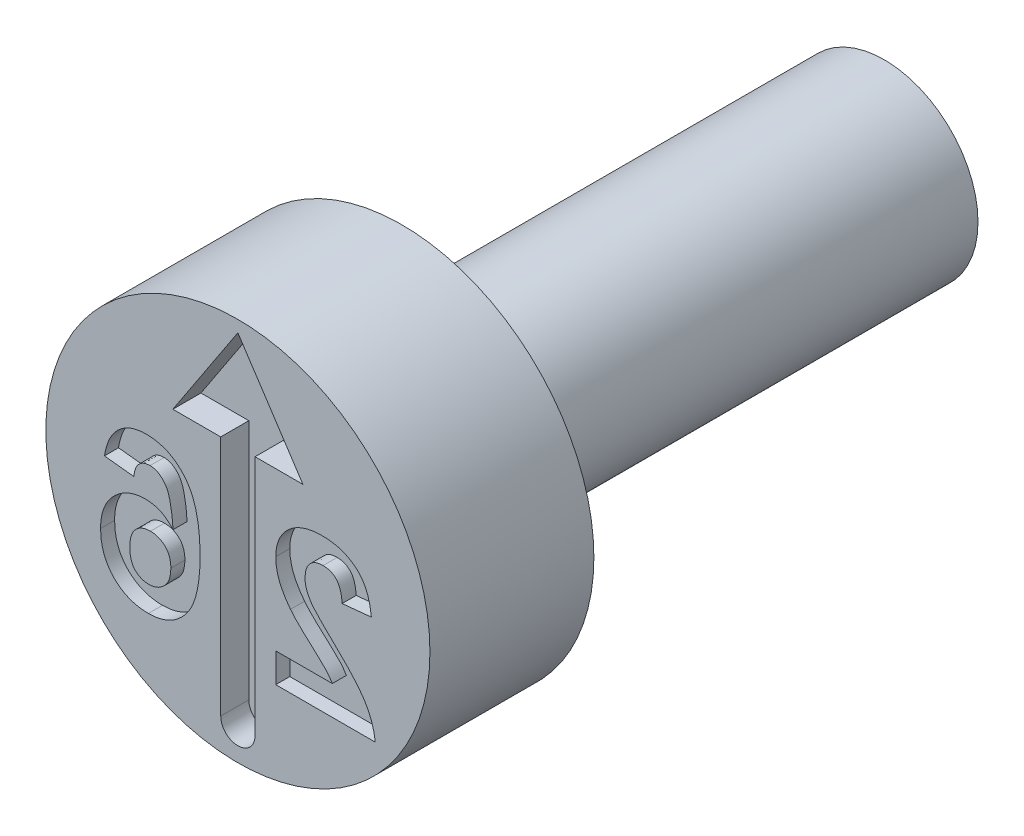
ISO-10303-21;
HEADER;
FILE_DESCRIPTION(('STEP AP214'),'2;1');
FILE_NAME('part.step','',(''),(''),'','','');
FILE_SCHEMA(('AUTOMOTIVE_DESIGN { 1 0 10303 214 1 1 1 1 }'));
ENDSEC;
DATA;
#1=APPLICATION_CONTEXT('core data for automotive mechanical design processes');
#2=APPLICATION_PROTOCOL_DEFINITION('international standard','automotive_design',2000,#1);
#3=PRODUCT_CONTEXT('',#1,'mechanical');
#4=PRODUCT('Part','Part','',(#3));
#5=PRODUCT_RELATED_PRODUCT_CATEGORY('part','',(#4));
#6=PRODUCT_DEFINITION_FORMATION('','',#4);
#7=PRODUCT_DEFINITION_CONTEXT('part definition',#1,'design');
#8=PRODUCT_DEFINITION('design','',#6,#7);
#9=PRODUCT_DEFINITION_SHAPE('','',#8);
#10=(LENGTH_UNIT() NAMED_UNIT(*) SI_UNIT(.MILLI.,.METRE.));
#11=(NAMED_UNIT(*) PLANE_ANGLE_UNIT() SI_UNIT($,.RADIAN.));
#12=(NAMED_UNIT(*) SI_UNIT($,.STERADIAN.) SOLID_ANGLE_UNIT());
#13=UNCERTAINTY_MEASURE_WITH_UNIT(LENGTH_MEASURE(1.E-05),#10,'distance_accuracy_value','');
#14=(GEOMETRIC_REPRESENTATION_CONTEXT(3) GLOBAL_UNCERTAINTY_ASSIGNED_CONTEXT((#13)) GLOBAL_UNIT_ASSIGNED_CONTEXT((#10,
#11,#12)) REPRESENTATION_CONTEXT('',''));
#15=CARTESIAN_POINT('',(0.,0.,0.));
#16=DIRECTION('',(0.,0.,1.));
#17=DIRECTION('',(1.,0.,0.));
#18=AXIS2_PLACEMENT_3D('',#15,#16,#17);
#19=CARTESIAN_POINT('',(0.,4.1,0.));
#20=DIRECTION('',(0.,0.,-1.));
#21=DIRECTION('',(-1.,0.,0.));
#22=AXIS2_PLACEMENT_3D('',#19,#20,#21);
#23=PLANE('',#22);
#24=DIRECTION('',(0.994071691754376,-0.108726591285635,0.));
#25=VECTOR('',#24,1.);
#26=CARTESIAN_POINT('',(-2.84833333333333,0.151692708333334,0.));
#27=LINE('',#26,#25);
#28=CARTESIAN_POINT('',(-2.84833333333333,0.151692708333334,0.));
#29=VERTEX_POINT('',#28);
#30=CARTESIAN_POINT('',(-2.22333333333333,0.0833333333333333,0.));
#31=VERTEX_POINT('',#30);
#32=EDGE_CURVE('E334',#29,#31,#27,.T.);
#33=ORIENTED_EDGE('',*,*,#32,.F.);
#34=CARTESIAN_POINT('',(-1.95640625,1.,0.));
#35=CARTESIAN_POINT('',(-1.9857383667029,0.999472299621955,0.));
#36=CARTESIAN_POINT('',(-2.0430789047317,0.998440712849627,0.));
#37=CARTESIAN_POINT('',(-2.12711971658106,0.987486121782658,0.));
#38=CARTESIAN_POINT('',(-2.20729386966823,0.970734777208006,0.));
#39=CARTESIAN_POINT('',(-2.28381149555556,0.947547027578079,0.));
#40=CARTESIAN_POINT('',(-2.35613385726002,0.916494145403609,0.));
#41=CARTESIAN_POINT('',(-2.42454814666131,0.878664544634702,0.));
#42=CARTESIAN_POINT('',(-2.48928436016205,0.834160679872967,0.));
#43=CARTESIAN_POINT('',(-2.55000566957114,0.783269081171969,0.));
#44=CARTESIAN_POINT('',(-2.60622337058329,0.725835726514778,0.));
#45=CARTESIAN_POINT('',(-2.65698665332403,0.661730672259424,0.));
#46=CARTESIAN_POINT('',(-2.70263169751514,0.591727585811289,0.));
#47=CARTESIAN_POINT('',(-2.74335826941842,0.51588456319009,0.));
#48=CARTESIAN_POINT('',(-2.77751904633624,0.43347521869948,0.));
#49=CARTESIAN_POINT('',(-2.80688587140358,0.345147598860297,0.));
#50=CARTESIAN_POINT('',(-2.83103804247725,0.250711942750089,0.));
#51=CARTESIAN_POINT('',(-2.84248033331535,0.185202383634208,0.));
#52=CARTESIAN_POINT('',(-2.84833333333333,0.151692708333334,0.));
#53=B_SPLINE_CURVE_WITH_KNOTS('',3,(#34,#35,#36,#37,#38,#39,#40,#41,#42,#43,#44,#45,#46,#47,#48,
#49,#50,#51,#52),.UNSPECIFIED.,.F.,.F.,(4,1,1,1,1,1,1,1,1,1,1,1,1,1,1,1,4),(0.,
0.0647517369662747,0.126581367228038,0.186839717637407,0.245514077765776,0.302849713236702,
0.360345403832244,0.417912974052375,0.476091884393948,0.535068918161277,0.595103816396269,
0.656390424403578,0.719434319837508,0.784953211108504,0.853160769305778,0.924888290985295,1.),.UNSPECIFIED.);
#54=CARTESIAN_POINT('',(-1.95640625,1.,0.));
#55=VERTEX_POINT('',#54);
#56=EDGE_CURVE('E54',#55,#29,#53,.T.);
#57=ORIENTED_EDGE('',*,*,#56,.F.);
#58=CARTESIAN_POINT('',(-0.806666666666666,-0.668619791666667,0.));
#59=CARTESIAN_POINT('',(-0.807638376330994,-0.597410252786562,0.));
#60=CARTESIAN_POINT('',(-0.809515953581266,-0.459816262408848,0.));
#61=CARTESIAN_POINT('',(-0.824624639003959,-0.261149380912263,0.));
#62=CARTESIAN_POINT('',(-0.848623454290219,-0.0776889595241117,0.));
#63=CARTESIAN_POINT('',(-0.88358374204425,0.0901512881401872,0.));
#64=CARTESIAN_POINT('',(-0.928300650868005,0.242719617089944,0.));
#65=CARTESIAN_POINT('',(-0.9825126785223,0.380322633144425,0.));
#66=CARTESIAN_POINT('',(-1.04758180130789,0.502462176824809,0.));
#67=CARTESIAN_POINT('',(-1.12323483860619,0.608741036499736,0.));
#68=CARTESIAN_POINT('',(-1.20647498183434,0.701125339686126,0.));
#69=CARTESIAN_POINT('',(-1.29591688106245,0.78086867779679,0.));
#70=CARTESIAN_POINT('',(-1.39121907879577,0.848742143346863,0.));
#71=CARTESIAN_POINT('',(-1.49237928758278,0.90457434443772,0.));
#72=CARTESIAN_POINT('',(-1.60022794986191,0.946900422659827,0.));
#73=CARTESIAN_POINT('',(-1.71374208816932,0.977465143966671,0.));
#74=CARTESIAN_POINT('',(-1.83311236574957,0.99710860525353,0.));
#75=CARTESIAN_POINT('',(-1.91487911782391,0.999026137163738,0.));
#76=CARTESIAN_POINT('',(-1.95640625,1.,0.));
#77=B_SPLINE_CURVE_WITH_KNOTS('',3,(#58,#59,#60,#61,#62,#63,#64,#65,#66,#67,#68,#69,#70,#71,#72,
#73,#74,#75,#76),.UNSPECIFIED.,.F.,.F.,(4,1,1,1,1,1,1,1,1,1,1,1,1,1,1,1,4),(0.,
0.0932311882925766,0.180145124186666,0.260720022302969,0.335343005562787,0.40439372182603,
0.46866345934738,0.528671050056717,0.585123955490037,0.639046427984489,0.691174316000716,
0.741714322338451,0.791946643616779,0.84207517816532,0.893016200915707,0.945665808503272,1.),.UNSPECIFIED.);
#78=CARTESIAN_POINT('',(-0.806666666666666,-0.668619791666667,0.));
#79=VERTEX_POINT('',#78);
#80=EDGE_CURVE('E385',#79,#55,#77,.T.);
#81=ORIENTED_EDGE('',*,*,#80,.F.);
#82=CARTESIAN_POINT('',(-1.90953125,-2.29166666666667,0.));
#83=CARTESIAN_POINT('',(-1.87018793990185,-2.29056594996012,0.));
#84=CARTESIAN_POINT('',(-1.79283199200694,-2.28840174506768,0.));
#85=CARTESIAN_POINT('',(-1.67959147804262,-2.2705914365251,0.));
#86=CARTESIAN_POINT('',(-1.57193203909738,-2.24045921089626,0.));
#87=CARTESIAN_POINT('',(-1.46986705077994,-2.19837827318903,0.));
#88=CARTESIAN_POINT('',(-1.37254818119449,-2.14544696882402,0.));
#89=CARTESIAN_POINT('',(-1.28087910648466,-2.07969663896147,0.));
#90=CARTESIAN_POINT('',(-1.19510274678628,-2.00175429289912,0.));
#91=CARTESIAN_POINT('',(-1.11408457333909,-1.91267544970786,0.));
#92=CARTESIAN_POINT('',(-1.04036020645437,-1.80978234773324,0.));
#93=CARTESIAN_POINT('',(-0.977575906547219,-1.69085956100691,0.));
#94=CARTESIAN_POINT('',(-0.92432852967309,-1.55720953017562,0.));
#95=CARTESIAN_POINT('',(-0.880977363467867,-1.40848949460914,0.));
#96=CARTESIAN_POINT('',(-0.847513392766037,-1.24471125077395,0.));
#97=CARTESIAN_POINT('',(-0.824162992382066,-1.0658610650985,0.));
#98=CARTESIAN_POINT('',(-0.808653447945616,-0.87223471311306,0.));
#99=CARTESIAN_POINT('',(-0.807344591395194,-0.738096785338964,0.));
#100=CARTESIAN_POINT('',(-0.806666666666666,-0.668619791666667,0.));
#101=B_SPLINE_CURVE_WITH_KNOTS('',3,(#82,#83,#84,#85,#86,#87,#88,#89,#90,#91,#92,#93,#94,#95,
#96,#97,#98,#99,#100),.UNSPECIFIED.,.F.,.F.,(4,1,1,1,1,1,1,1,1,1,1,1,1,1,1,1,4),(0.,
0.0532594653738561,0.104717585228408,0.154775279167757,0.20433007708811,0.25391362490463,
0.304476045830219,0.356706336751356,0.410596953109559,0.467274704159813,0.52762561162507,
0.59224090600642,0.661798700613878,0.737130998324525,0.818387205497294,0.905933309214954,1.),.UNSPECIFIED.);
#102=CARTESIAN_POINT('',(-1.90953125,-2.29166666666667,0.));
#103=VERTEX_POINT('',#102);
#104=EDGE_CURVE('E377',#103,#79,#101,.T.);
#105=ORIENTED_EDGE('',*,*,#104,.F.);
#106=CARTESIAN_POINT('',(-2.93166666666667,-1.23177083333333,0.));
#107=CARTESIAN_POINT('',(-2.93076453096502,-1.27086624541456,0.));
#108=CARTESIAN_POINT('',(-2.9290051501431,-1.34711166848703,0.));
#109=CARTESIAN_POINT('',(-2.91605487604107,-1.45877489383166,0.));
#110=CARTESIAN_POINT('',(-2.89317918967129,-1.5641724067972,0.));
#111=CARTESIAN_POINT('',(-2.86192606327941,-1.66414981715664,0.));
#112=CARTESIAN_POINT('',(-2.82150105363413,-1.757914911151,0.));
#113=CARTESIAN_POINT('',(-2.77252943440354,-1.84624041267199,0.));
#114=CARTESIAN_POINT('',(-2.71335396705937,-1.92761690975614,0.));
#115=CARTESIAN_POINT('',(-2.64666017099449,-2.00313903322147,0.));
#116=CARTESIAN_POINT('',(-2.57230978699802,-2.07053275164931,0.));
#117=CARTESIAN_POINT('',(-2.4930733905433,-2.13021068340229,0.));
#118=CARTESIAN_POINT('',(-2.40807213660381,-2.17981920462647,0.));
#119=CARTESIAN_POINT('',(-2.31856244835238,-2.22157327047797,0.));
#120=CARTESIAN_POINT('',(-2.223006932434,-2.25221527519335,0.));
#121=CARTESIAN_POINT('',(-2.12309021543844,-2.27519523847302,0.));
#122=CARTESIAN_POINT('',(-2.01799984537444,-2.2892109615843,0.));
#123=CARTESIAN_POINT('',(-1.94624988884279,-2.29083536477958,0.));
#124=CARTESIAN_POINT('',(-1.90953125,-2.29166666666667,0.));
#125=B_SPLINE_CURVE_WITH_KNOTS('',3,(#106,#107,#108,#109,#110,#111,#112,#113,#114,#115,#116,
#117,#118,#119,#120,#121,#122,#123,#124),.UNSPECIFIED.,.F.,.F.,(4,1,1,1,1,1,1,1,1,1,1,1,1,1,1,1,
4),(0.,0.0708046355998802,0.13808600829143,0.203231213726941,0.265884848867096,
0.327509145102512,0.387868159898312,0.448411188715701,0.509386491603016,0.570040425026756,
0.629864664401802,0.688715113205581,0.747985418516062,0.80839432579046,0.870086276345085,
0.933515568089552,1.),.UNSPECIFIED.);
#126=CARTESIAN_POINT('',(-2.93166666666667,-1.23177083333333,0.));
#127=VERTEX_POINT('',#126);
#128=EDGE_CURVE('E369',#127,#103,#125,.T.);
#129=ORIENTED_EDGE('',*,*,#128,.F.);
#130=CARTESIAN_POINT('',(-1.97138020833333,-0.208333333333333,0.));
#131=CARTESIAN_POINT('',(-2.00375255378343,-0.209265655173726,0.));
#132=CARTESIAN_POINT('',(-2.06767643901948,-0.211106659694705,0.));
#133=CARTESIAN_POINT('',(-2.16185116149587,-0.224019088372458,0.));
#134=CARTESIAN_POINT('',(-2.25221799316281,-0.247237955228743,0.));
#135=CARTESIAN_POINT('',(-2.33918573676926,-0.27864722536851,0.));
#136=CARTESIAN_POINT('',(-2.42318422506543,-0.318199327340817,0.));
#137=CARTESIAN_POINT('',(-2.5026066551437,-0.368266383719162,0.));
#138=CARTESIAN_POINT('',(-2.57869975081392,-0.426642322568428,0.));
#139=CARTESIAN_POINT('',(-2.65041700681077,-0.493336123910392,0.));
#140=CARTESIAN_POINT('',(-2.71630791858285,-0.566760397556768,0.));
#141=CARTESIAN_POINT('',(-2.77448307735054,-0.646064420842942,0.));
#142=CARTESIAN_POINT('',(-2.82235932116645,-0.73149037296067,0.));
#143=CARTESIAN_POINT('',(-2.86328777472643,-0.821125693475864,0.));
#144=CARTESIAN_POINT('',(-2.89374010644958,-0.916739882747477,0.));
#145=CARTESIAN_POINT('',(-2.91584528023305,-1.01695705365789,0.));
#146=CARTESIAN_POINT('',(-2.92904051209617,-1.12269711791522,0.));
#147=CARTESIAN_POINT('',(-2.93077750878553,-1.19484088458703,0.));
#148=CARTESIAN_POINT('',(-2.93166666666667,-1.23177083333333,0.));
#149=B_SPLINE_CURVE_WITH_KNOTS('',3,(#130,#131,#132,#133,#134,#135,#136,#137,#138,#139,#140,
#141,#142,#143,#144,#145,#146,#147,#148),.UNSPECIFIED.,.F.,.F.,(4,1,1,1,1,1,1,1,1,1,1,1,1,1,1,1,
4),(0.,0.0619593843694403,0.12234777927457,0.181484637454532,0.240217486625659,
0.299114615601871,0.358819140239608,0.419550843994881,0.482449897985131,0.545990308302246,
0.608137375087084,0.670271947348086,0.733113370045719,0.796428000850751,0.8619364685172,
0.9293261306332,1.),.UNSPECIFIED.);
#150=CARTESIAN_POINT('',(-1.97138020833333,-0.208333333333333,0.));
#151=VERTEX_POINT('',#150);
#152=EDGE_CURVE('E361',#151,#127,#149,.T.);
#153=ORIENTED_EDGE('',*,*,#152,.F.);
#154=CARTESIAN_POINT('',(-1.384140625,-0.48046875,0.));
#155=CARTESIAN_POINT('',(-1.40411571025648,-0.458773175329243,0.));
#156=CARTESIAN_POINT('',(-1.44328475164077,-0.416230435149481,0.));
#157=CARTESIAN_POINT('',(-1.5082785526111,-0.360764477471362,0.));
#158=CARTESIAN_POINT('',(-1.57636923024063,-0.313344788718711,0.));
#159=CARTESIAN_POINT('',(-1.64829770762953,-0.274441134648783,0.));
#160=CARTESIAN_POINT('',(-1.72445659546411,-0.245490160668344,0.));
#161=CARTESIAN_POINT('',(-1.80346633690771,-0.223508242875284,0.));
#162=CARTESIAN_POINT('',(-1.88636117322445,-0.211195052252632,0.));
#163=CARTESIAN_POINT('',(-1.94269615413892,-0.209298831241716,0.));
#164=CARTESIAN_POINT('',(-1.97138020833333,-0.208333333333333,0.));
#165=B_SPLINE_CURVE_WITH_KNOTS('',3,(#154,#155,#156,#157,#158,#159,#160,#161,#162,#163,#164),
.UNSPECIFIED.,.F.,.F.,(4,1,1,1,1,1,1,1,4),(0.,0.132218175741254,0.259265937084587,
0.382426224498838,0.503963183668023,0.62510949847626,0.747226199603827,0.871295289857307,1.),.UNSPECIFIED.);
#166=CARTESIAN_POINT('',(-1.384140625,-0.48046875,0.));
#167=VERTEX_POINT('',#166);
#168=EDGE_CURVE('E353',#167,#151,#165,.T.);
#169=ORIENTED_EDGE('',*,*,#168,.F.);
#170=CARTESIAN_POINT('',(-1.876328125,0.458333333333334,0.));
#171=CARTESIAN_POINT('',(-1.86065326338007,0.457950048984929,0.));
#172=CARTESIAN_POINT('',(-1.82946108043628,0.457187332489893,0.));
#173=CARTESIAN_POINT('',(-1.78402587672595,0.44750386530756,0.));
#174=CARTESIAN_POINT('',(-1.74022087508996,0.43313353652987,0.));
#175=CARTESIAN_POINT('',(-1.69840358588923,0.412780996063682,0.));
#176=CARTESIAN_POINT('',(-1.65836536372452,0.386519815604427,0.));
#177=CARTESIAN_POINT('',(-1.62071488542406,0.354036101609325,0.));
#178=CARTESIAN_POINT('',(-1.58372120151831,0.317042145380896,0.));
#179=CARTESIAN_POINT('',(-1.54956172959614,0.272370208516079,0.));
#180=CARTESIAN_POINT('',(-1.51678969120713,0.219475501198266,0.));
#181=CARTESIAN_POINT('',(-1.48857164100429,0.154722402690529,0.));
#182=CARTESIAN_POINT('',(-1.46342087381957,0.078171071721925,0.));
#183=CARTESIAN_POINT('',(-1.44188643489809,-0.0105534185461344,0.));
#184=CARTESIAN_POINT('',(-1.42234415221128,-0.110887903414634,0.));
#185=CARTESIAN_POINT('',(-1.40632502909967,-0.223238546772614,0.));
#186=CARTESIAN_POINT('',(-1.39350662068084,-0.347706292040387,0.));
#187=CARTESIAN_POINT('',(-1.38735713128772,-0.434874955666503,0.));
#188=CARTESIAN_POINT('',(-1.384140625,-0.48046875,0.));
#189=B_SPLINE_CURVE_WITH_KNOTS('',3,(#170,#171,#172,#173,#174,#175,#176,#177,#178,#179,#180,
#181,#182,#183,#184,#185,#186,#187,#188),.UNSPECIFIED.,.F.,.F.,(4,1,1,1,1,1,1,1,1,1,1,1,1,1,1,1,
4),(0.,0.0401536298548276,0.0799036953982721,0.118642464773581,0.158240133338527,
0.198858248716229,0.241137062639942,0.285631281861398,0.332856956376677,0.385095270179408,
0.444912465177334,0.513585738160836,0.591645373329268,0.679009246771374,0.775790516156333,
0.882726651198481,1.),.UNSPECIFIED.);
#190=CARTESIAN_POINT('',(-1.876328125,0.458333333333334,0.));
#191=VERTEX_POINT('',#190);
#192=EDGE_CURVE('E345',#191,#167,#189,.T.);
#193=ORIENTED_EDGE('',*,*,#192,.F.);
#194=CARTESIAN_POINT('',(-2.22333333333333,0.0833333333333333,0.));
#195=CARTESIAN_POINT('',(-2.2191460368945,0.113436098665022,0.));
#196=CARTESIAN_POINT('',(-2.21126630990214,0.170084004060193,0.));
#197=CARTESIAN_POINT('',(-2.18792696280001,0.248258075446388,0.));
#198=CARTESIAN_POINT('',(-2.1554359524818,0.31402242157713,0.));
#199=CARTESIAN_POINT('',(-2.11373059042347,0.367468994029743,0.));
#200=CARTESIAN_POINT('',(-2.06405511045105,0.408603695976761,0.));
#201=CARTESIAN_POINT('',(-2.00745258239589,0.437832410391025,0.));
#202=CARTESIAN_POINT('',(-1.94395898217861,0.455183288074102,0.));
#203=CARTESIAN_POINT('',(-1.89944303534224,0.45725670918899,0.));
#204=CARTESIAN_POINT('',(-1.876328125,0.458333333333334,0.));
#205=B_SPLINE_CURVE_WITH_KNOTS('',3,(#194,#195,#196,#197,#198,#199,#200,#201,#202,#203,#204),
.UNSPECIFIED.,.F.,.F.,(4,1,1,1,1,1,1,1,4),(0.,0.160089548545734,0.301259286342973,
0.428171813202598,0.544692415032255,0.65604141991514,0.765564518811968,0.878269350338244,1.),.UNSPECIFIED.);
#206=EDGE_CURVE('E340',#31,#191,#205,.T.);
#207=ORIENTED_EDGE('',*,*,#206,.F.);
#208=EDGE_LOOP('',(#33,#57,#81,#105,#129,#153,#169,#193,#207));
#209=FACE_BOUND('',#208,.T.);
#210=CARTESIAN_POINT('',(0.,0.,0.));
#211=DIRECTION('',(0.,0.,1.));
#212=DIRECTION('',(1.,0.,0.));
#213=AXIS2_PLACEMENT_3D('',#210,#211,#212);
#214=CIRCLE('',#213,4.1);
#215=CARTESIAN_POINT('',(4.1,0.,0.));
#216=VERTEX_POINT('',#215);
#217=EDGE_CURVE('E47',#216,#216,#214,.T.);
#218=ORIENTED_EDGE('',*,*,#217,.T.);
#219=EDGE_LOOP('',(#218));
#220=FACE_BOUND('',#219,.T.);
#221=DIRECTION('',(0.,1.,0.));
#222=VECTOR('',#221,1.);
#223=CARTESIAN_POINT('',(0.366422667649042,1.74359356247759,0.));
#224=LINE('',#223,#222);
#225=CARTESIAN_POINT('',(0.366422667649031,-3.4168913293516,0.));
#226=VERTEX_POINT('',#225);
#227=CARTESIAN_POINT('',(0.366422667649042,1.74359356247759,0.));
#228=VERTEX_POINT('',#227);
#229=EDGE_CURVE('E527',#226,#228,#224,.T.);
#230=ORIENTED_EDGE('',*,*,#229,.F.);
#231=CARTESIAN_POINT('',(3.14387868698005E-13,-3.4168913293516,0.));
#232=DIRECTION('',(0.,0.,1.));
#233=DIRECTION('',(1.,0.,0.));
#234=AXIS2_PLACEMENT_3D('',#231,#232,#233);
#235=CIRCLE('',#234,0.366422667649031);
#236=CARTESIAN_POINT('',(-0.366422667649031,-3.4168913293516,0.));
#237=VERTEX_POINT('',#236);
#238=EDGE_CURVE('E619',#237,#226,#235,.T.);
#239=ORIENTED_EDGE('',*,*,#238,.F.);
#240=DIRECTION('',(0.,-1.,0.));
#241=VECTOR('',#240,1.);
#242=CARTESIAN_POINT('',(-0.366422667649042,1.74359356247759,0.));
#243=LINE('',#242,#241);
#244=CARTESIAN_POINT('',(-0.366422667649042,1.74359356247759,0.));
#245=VERTEX_POINT('',#244);
#246=EDGE_CURVE('E649',#245,#237,#243,.T.);
#247=ORIENTED_EDGE('',*,*,#246,.F.);
#248=DIRECTION('',(1.,0.,0.));
#249=VECTOR('',#248,1.);
#250=CARTESIAN_POINT('',(-1.38878912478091,1.74359356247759,0.));
#251=LINE('',#250,#249);
#252=CARTESIAN_POINT('',(-1.38878912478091,1.74359356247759,0.));
#253=VERTEX_POINT('',#252);
#254=EDGE_CURVE('E679',#253,#245,#251,.T.);
#255=ORIENTED_EDGE('',*,*,#254,.F.);
#256=DIRECTION('',(-0.550159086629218,-0.835059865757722,0.));
#257=VECTOR('',#256,1.);
#258=CARTESIAN_POINT('',(0.,3.85156939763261,0.));
#259=LINE('',#258,#257);
#260=CARTESIAN_POINT('',(0.,3.85156939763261,0.));
#261=VERTEX_POINT('',#260);
#262=EDGE_CURVE('E676',#261,#253,#259,.T.);
#263=ORIENTED_EDGE('',*,*,#262,.F.);
#264=DIRECTION('',(-0.550159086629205,0.835059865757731,0.));
#265=VECTOR('',#264,1.);
#266=CARTESIAN_POINT('',(0.,3.85156939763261,0.));
#267=LINE('',#266,#265);
#268=CARTESIAN_POINT('',(1.38878912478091,1.74359356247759,0.));
#269=VERTEX_POINT('',#268);
#270=EDGE_CURVE('E673',#269,#261,#267,.T.);
#271=ORIENTED_EDGE('',*,*,#270,.F.);
#272=DIRECTION('',(1.,0.,0.));
#273=VECTOR('',#272,1.);
#274=CARTESIAN_POINT('',(1.38878912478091,1.74359356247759,0.));
#275=LINE('',#274,#273);
#276=EDGE_CURVE('E670',#228,#269,#275,.T.);
#277=ORIENTED_EDGE('',*,*,#276,.F.);
#278=EDGE_LOOP('',(#230,#239,#247,#255,#263,#271,#277));
#279=FACE_BOUND('',#278,.T.);
#280=DIRECTION('',(0.,-1.,0.));
#281=VECTOR('',#280,1.);
#282=CARTESIAN_POINT('',(0.808333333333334,-1.625,0.));
#283=LINE('',#282,#281);
#284=CARTESIAN_POINT('',(0.808333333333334,-1.625,0.));
#285=VERTEX_POINT('',#284);
#286=CARTESIAN_POINT('',(0.808333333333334,-2.25,0.));
#287=VERTEX_POINT('',#286);
#288=EDGE_CURVE('E532',#285,#287,#283,.T.);
#289=ORIENTED_EDGE('',*,*,#288,.F.);
#290=DIRECTION('',(-1.,0.,0.));
#291=VECTOR('',#290,1.);
#292=CARTESIAN_POINT('',(2.016015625,-1.625,0.));
#293=LINE('',#292,#291);
#294=CARTESIAN_POINT('',(2.016015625,-1.625,0.));
#295=VERTEX_POINT('',#294);
#296=EDGE_CURVE('E399',#295,#285,#293,.T.);
#297=ORIENTED_EDGE('',*,*,#296,.F.);
#298=CARTESIAN_POINT('',(1.1234375,-0.69921875,0.));
#299=CARTESIAN_POINT('',(1.13332267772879,-0.711669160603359,0.));
#300=CARTESIAN_POINT('',(1.15449443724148,-0.738335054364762,0.));
#301=CARTESIAN_POINT('',(1.19051316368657,-0.779223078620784,0.));
#302=CARTESIAN_POINT('',(1.2322557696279,-0.823885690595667,0.));
#303=CARTESIAN_POINT('',(1.27913265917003,-0.873158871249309,0.));
#304=CARTESIAN_POINT('',(1.33269226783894,-0.925297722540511,0.));
#305=CARTESIAN_POINT('',(1.39100751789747,-0.982482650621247,0.));
#306=CARTESIAN_POINT('',(1.45664445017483,-1.04178845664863,0.));
#307=CARTESIAN_POINT('',(1.52462840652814,-1.10469453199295,0.));
#308=CARTESIAN_POINT('',(1.59290786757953,-1.16592013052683,0.));
#309=CARTESIAN_POINT('',(1.65566653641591,-1.22407087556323,0.));
#310=CARTESIAN_POINT('',(1.71267229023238,-1.27552179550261,0.));
#311=CARTESIAN_POINT('',(1.76127026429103,-1.32311321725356,0.));
#312=CARTESIAN_POINT('',(1.80431897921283,-1.36359706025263,0.));
#313=CARTESIAN_POINT('',(1.84026681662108,-1.39904928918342,0.));
#314=CARTESIAN_POINT('',(1.86978644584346,-1.42861163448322,0.));
#315=CARTESIAN_POINT('',(1.91046259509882,-1.47469183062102,0.));
#316=CARTESIAN_POINT('',(1.96221837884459,-1.53701531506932,0.));
#317=CARTESIAN_POINT('',(1.99863068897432,-1.59656716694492,0.));
#318=CARTESIAN_POINT('',(2.016015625,-1.625,0.));
#319=B_SPLINE_CURVE_WITH_KNOTS('',3,(#298,#299,#300,#301,#302,#303,#304,#305,#306,#307,#308,
#309,#310,#311,#312,#313,#314,#315,#316,#317,#318),.UNSPECIFIED.,.F.,.F.,(4,1,1,1,1,1,1,1,1,1,1,
1,1,1,1,1,1,1,4),(0.,0.0369753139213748,0.0791925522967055,0.126700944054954,0.179184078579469,
0.23736864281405,0.300558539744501,0.369153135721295,0.443112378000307,0.516018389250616,
0.582473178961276,0.642136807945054,0.694619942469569,0.740679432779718,0.779589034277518,
0.812073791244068,0.837814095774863,0.922564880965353,1.),.UNSPECIFIED.);
#320=CARTESIAN_POINT('',(1.1234375,-0.69921875,0.));
#321=VERTEX_POINT('',#320);
#322=EDGE_CURVE('E419',#321,#295,#319,.T.);
#323=ORIENTED_EDGE('',*,*,#322,.F.);
#324=CARTESIAN_POINT('',(0.808333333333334,0.115885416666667,0.));
#325=CARTESIAN_POINT('',(0.809128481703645,0.0804589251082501,0.));
#326=CARTESIAN_POINT('',(0.810705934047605,0.0101782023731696,0.));
#327=CARTESIAN_POINT('',(0.825808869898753,-0.0937177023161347,0.));
#328=CARTESIAN_POINT('',(0.848883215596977,-0.195217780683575,0.));
#329=CARTESIAN_POINT('',(0.882985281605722,-0.294570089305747,0.));
#330=CARTESIAN_POINT('',(0.92621229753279,-0.394157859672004,0.));
#331=CARTESIAN_POINT('',(0.981932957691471,-0.494204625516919,0.));
#332=CARTESIAN_POINT('',(1.04662885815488,-0.597727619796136,0.));
#333=CARTESIAN_POINT('',(1.09728319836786,-0.664659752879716,0.));
#334=CARTESIAN_POINT('',(1.1234375,-0.69921875,0.));
#335=B_SPLINE_CURVE_WITH_KNOTS('',3,(#324,#325,#326,#327,#328,#329,#330,#331,#332,#333,#334),
.UNSPECIFIED.,.F.,.F.,(4,1,1,1,1,1,1,1,4),(0.,0.119176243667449,0.236427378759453,
0.352663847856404,0.469086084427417,0.589462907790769,0.717601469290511,0.854189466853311,1.),.UNSPECIFIED.);
#336=CARTESIAN_POINT('',(0.808333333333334,0.115885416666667,0.));
#337=VERTEX_POINT('',#336);
#338=EDGE_CURVE('E599',#337,#321,#335,.T.);
#339=ORIENTED_EDGE('',*,*,#338,.F.);
#340=CARTESIAN_POINT('',(1.80572916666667,1.,0.));
#341=CARTESIAN_POINT('',(1.76794079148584,0.999273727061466,0.));
#342=CARTESIAN_POINT('',(1.69434318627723,0.997859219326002,0.));
#343=CARTESIAN_POINT('',(1.58690374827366,0.986178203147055,0.));
#344=CARTESIAN_POINT('',(1.48597211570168,0.965810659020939,0.));
#345=CARTESIAN_POINT('',(1.39066587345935,0.938830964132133,0.));
#346=CARTESIAN_POINT('',(1.30196376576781,0.902811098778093,0.));
#347=CARTESIAN_POINT('',(1.2191266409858,0.859264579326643,0.));
#348=CARTESIAN_POINT('',(1.14345821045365,0.806538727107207,0.));
#349=CARTESIAN_POINT('',(1.07383053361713,0.747508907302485,0.));
#350=CARTESIAN_POINT('',(1.01158896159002,0.682595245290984,0.));
#351=CARTESIAN_POINT('',(0.957070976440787,0.613353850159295,0.));
#352=CARTESIAN_POINT('',(0.911395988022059,0.539832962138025,0.));
#353=CARTESIAN_POINT('',(0.873067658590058,0.462928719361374,0.));
#354=CARTESIAN_POINT('',(0.84460913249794,0.381403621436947,0.));
#355=CARTESIAN_POINT('',(0.823873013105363,0.296384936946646,0.));
#356=CARTESIAN_POINT('',(0.810124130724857,0.207476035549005,0.));
#357=CARTESIAN_POINT('',(0.808936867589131,0.146753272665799,0.));
#358=CARTESIAN_POINT('',(0.808333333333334,0.115885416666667,0.));
#359=B_SPLINE_CURVE_WITH_KNOTS('',3,(#340,#341,#342,#343,#344,#345,#346,#347,#348,#349,#350,
#351,#352,#353,#354,#355,#356,#357,#358),.UNSPECIFIED.,.F.,.F.,(4,1,1,1,1,1,1,1,1,1,1,1,1,1,1,1,
4),(0.,0.0756723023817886,0.147381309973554,0.216084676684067,0.281698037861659,
0.345459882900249,0.407485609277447,0.46873129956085,0.529782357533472,0.590032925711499,
0.648548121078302,0.70595351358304,0.763101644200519,0.820289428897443,0.878479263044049,
0.938226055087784,1.),.UNSPECIFIED.);
#360=CARTESIAN_POINT('',(1.80572916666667,1.,0.));
#361=VERTEX_POINT('',#360);
#362=EDGE_CURVE('E591',#361,#337,#359,.T.);
#363=ORIENTED_EDGE('',*,*,#362,.F.);
#364=CARTESIAN_POINT('',(2.85,0.01953125,0.));
#365=CARTESIAN_POINT('',(2.84497509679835,0.0617266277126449,0.));
#366=CARTESIAN_POINT('',(2.83523261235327,0.14353672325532,0.));
#367=CARTESIAN_POINT('',(2.81092007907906,0.261044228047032,0.));
#368=CARTESIAN_POINT('',(2.78012915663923,0.369450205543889,0.));
#369=CARTESIAN_POINT('',(2.74139193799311,0.468553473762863,0.));
#370=CARTESIAN_POINT('',(2.6963094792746,0.558984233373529,0.));
#371=CARTESIAN_POINT('',(2.64258220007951,0.639385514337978,0.));
#372=CARTESIAN_POINT('',(2.58208738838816,0.71064793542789,0.));
#373=CARTESIAN_POINT('',(2.51477276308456,0.77273356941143,0.));
#374=CARTESIAN_POINT('',(2.44106626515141,0.825839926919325,0.));
#375=CARTESIAN_POINT('',(2.36372452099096,0.873245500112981,0.));
#376=CARTESIAN_POINT('',(2.28123605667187,0.912133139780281,0.));
#377=CARTESIAN_POINT('',(2.19450907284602,0.944182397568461,0.));
#378=CARTESIAN_POINT('',(2.10358276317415,0.969795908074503,0.));
#379=CARTESIAN_POINT('',(2.00803658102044,0.986731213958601,0.));
#380=CARTESIAN_POINT('',(1.90846020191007,0.998643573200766,0.));
#381=CARTESIAN_POINT('',(1.84048894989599,0.99954104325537,0.));
#382=CARTESIAN_POINT('',(1.80572916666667,1.,0.));
#383=B_SPLINE_CURVE_WITH_KNOTS('',3,(#364,#365,#366,#367,#368,#369,#370,#371,#372,#373,#374,
#375,#376,#377,#378,#379,#380,#381,#382),.UNSPECIFIED.,.F.,.F.,(4,1,1,1,1,1,1,1,1,1,1,1,1,1,1,1,
4),(0.,0.0794357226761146,0.154013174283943,0.224141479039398,0.289934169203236,
0.352732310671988,0.41272577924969,0.470302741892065,0.527168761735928,0.583502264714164,
0.639948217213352,0.696584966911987,0.753726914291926,0.812707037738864,0.872963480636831,
0.935034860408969,1.),.UNSPECIFIED.);
#384=CARTESIAN_POINT('',(2.85,0.01953125,0.));
#385=VERTEX_POINT('',#384);
#386=EDGE_CURVE('E586',#385,#361,#383,.T.);
#387=ORIENTED_EDGE('',*,*,#386,.F.);
#388=DIRECTION('',(0.995240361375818,0.0974506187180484,0.));
#389=VECTOR('',#388,1.);
#390=CARTESIAN_POINT('',(2.225,-0.0416666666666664,0.));
#391=LINE('',#390,#389);
#392=CARTESIAN_POINT('',(2.225,-0.0416666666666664,0.));
#393=VERTEX_POINT('',#392);
#394=EDGE_CURVE('E580',#393,#385,#391,.T.);
#395=ORIENTED_EDGE('',*,*,#394,.F.);
#396=CARTESIAN_POINT('',(1.81875,0.458333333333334,0.));
#397=CARTESIAN_POINT('',(1.84709727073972,0.457049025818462,0.));
#398=CARTESIAN_POINT('',(1.90185807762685,0.454568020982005,0.));
#399=CARTESIAN_POINT('',(1.97968506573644,0.432894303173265,0.));
#400=CARTESIAN_POINT('',(2.04776931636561,0.395374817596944,0.));
#401=CARTESIAN_POINT('',(2.09628977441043,0.352617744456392,0.));
#402=CARTESIAN_POINT('',(2.12906764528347,0.311039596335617,0.));
#403=CARTESIAN_POINT('',(2.15140134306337,0.27480697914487,0.));
#404=CARTESIAN_POINT('',(2.17065124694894,0.233635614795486,0.));
#405=CARTESIAN_POINT('',(2.18770826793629,0.187989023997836,0.));
#406=CARTESIAN_POINT('',(2.20118138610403,0.137344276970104,0.));
#407=CARTESIAN_POINT('',(2.21203179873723,0.0820870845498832,0.));
#408=CARTESIAN_POINT('',(2.22077566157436,0.0219200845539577,0.));
#409=CARTESIAN_POINT('',(2.22355636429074,-0.0199363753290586,0.));
#410=CARTESIAN_POINT('',(2.225,-0.0416666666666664,0.));
#411=B_SPLINE_CURVE_WITH_KNOTS('',3,(#396,#397,#398,#399,#400,#401,#402,#403,#404,#405,#406,
#407,#408,#409,#410),.UNSPECIFIED.,.F.,.F.,(4,1,1,1,1,1,1,1,1,1,1,1,4),(0.,0.116899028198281,
0.225823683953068,0.330086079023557,0.435451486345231,0.490306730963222,0.548244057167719,
0.610766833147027,0.677675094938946,0.749188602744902,0.826858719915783,0.910111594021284,1.),.UNSPECIFIED.);
#412=CARTESIAN_POINT('',(1.81875,0.458333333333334,0.));
#413=VERTEX_POINT('',#412);
#414=EDGE_CURVE('E572',#413,#393,#411,.T.);
#415=ORIENTED_EDGE('',*,*,#414,.F.);
#416=CARTESIAN_POINT('',(1.43333333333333,0.0319010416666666,0.));
#417=CARTESIAN_POINT('',(1.43450387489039,0.0643275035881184,0.));
#418=CARTESIAN_POINT('',(1.43671844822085,0.125675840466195,0.));
#419=CARTESIAN_POINT('',(1.45528802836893,0.212249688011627,0.));
#420=CARTESIAN_POINT('',(1.48821816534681,0.286672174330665,0.));
#421=CARTESIAN_POINT('',(1.53355690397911,0.349171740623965,0.));
#422=CARTESIAN_POINT('',(1.59088782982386,0.398139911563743,0.));
#423=CARTESIAN_POINT('',(1.65790934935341,0.434322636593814,0.));
#424=CARTESIAN_POINT('',(1.73560255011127,0.454326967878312,0.));
#425=CARTESIAN_POINT('',(1.79020991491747,0.45695816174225,0.));
#426=CARTESIAN_POINT('',(1.81875,0.458333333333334,0.));
#427=B_SPLINE_CURVE_WITH_KNOTS('',3,(#416,#417,#418,#419,#420,#421,#422,#423,#424,#425,#426),
.UNSPECIFIED.,.F.,.F.,(4,1,1,1,1,1,1,1,4),(0.,0.149140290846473,0.282161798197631,
0.404655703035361,0.521109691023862,0.634416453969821,0.748796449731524,0.868710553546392,1.),.UNSPECIFIED.);
#428=CARTESIAN_POINT('',(1.43333333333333,0.0319010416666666,0.));
#429=VERTEX_POINT('',#428);
#430=EDGE_CURVE('E564',#429,#413,#427,.T.);
#431=ORIENTED_EDGE('',*,*,#430,.F.);
#432=CARTESIAN_POINT('',(1.55703125,-0.34375,0.));
#433=CARTESIAN_POINT('',(1.53821390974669,-0.312492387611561,0.));
#434=CARTESIAN_POINT('',(1.50191744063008,-0.252200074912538,0.));
#435=CARTESIAN_POINT('',(1.46211535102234,-0.157389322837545,0.));
#436=CARTESIAN_POINT('',(1.43822465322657,-0.0625981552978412,0.));
#437=CARTESIAN_POINT('',(1.43494620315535,0.000740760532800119,0.));
#438=CARTESIAN_POINT('',(1.43333333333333,0.0319010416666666,0.));
#439=B_SPLINE_CURVE_WITH_KNOTS('',3,(#432,#433,#434,#435,#436,#437,#438),.UNSPECIFIED.,.F.,.F.,
(4,1,1,1,4),(0.,0.272795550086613,0.526191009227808,0.766904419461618,1.),.UNSPECIFIED.);
#440=CARTESIAN_POINT('',(1.55703125,-0.34375,0.));
#441=VERTEX_POINT('',#440);
#442=EDGE_CURVE('E556',#441,#429,#439,.T.);
#443=ORIENTED_EDGE('',*,*,#442,.F.);
#444=CARTESIAN_POINT('',(2.05442708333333,-0.868489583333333,0.));
#445=CARTESIAN_POINT('',(2.02229423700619,-0.837472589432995,0.));
#446=CARTESIAN_POINT('',(1.9611227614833,-0.778425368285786,0.));
#447=CARTESIAN_POINT('',(1.87401446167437,-0.693872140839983,0.));
#448=CARTESIAN_POINT('',(1.79743729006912,-0.616143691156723,0.));
#449=CARTESIAN_POINT('',(1.72979012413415,-0.547254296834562,0.));
#450=CARTESIAN_POINT('',(1.67263570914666,-0.4854498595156,0.));
#451=CARTESIAN_POINT('',(1.62522223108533,-0.431701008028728,0.));
#452=CARTESIAN_POINT('',(1.58694920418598,-0.385788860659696,0.));
#453=CARTESIAN_POINT('',(1.56622049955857,-0.356662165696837,0.));
#454=CARTESIAN_POINT('',(1.55703125,-0.34375,0.));
#455=B_SPLINE_CURVE_WITH_KNOTS('',3,(#444,#445,#446,#447,#448,#449,#450,#451,#452,#453,#454),
.UNSPECIFIED.,.F.,.F.,(4,1,1,1,1,1,1,1,4),(0.,0.18509006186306,0.352356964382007,
0.503079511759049,0.637279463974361,0.752473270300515,0.851885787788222,0.934339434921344,1.),.UNSPECIFIED.);
#456=CARTESIAN_POINT('',(2.05442708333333,-0.868489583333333,0.));
#457=VERTEX_POINT('',#456);
#458=EDGE_CURVE('E548',#457,#441,#455,.T.);
#459=ORIENTED_EDGE('',*,*,#458,.F.);
#460=CARTESIAN_POINT('',(2.93333333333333,-2.25,0.));
#461=CARTESIAN_POINT('',(2.92613857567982,-2.19658468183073,0.));
#462=CARTESIAN_POINT('',(2.91175309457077,-2.08978399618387,0.));
#463=CARTESIAN_POINT('',(2.8672783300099,-1.93377507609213,0.));
#464=CARTESIAN_POINT('',(2.80791975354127,-1.7815370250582,0.));
#465=CARTESIAN_POINT('',(2.7434972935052,-1.65765220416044,0.));
#466=CARTESIAN_POINT('',(2.67942202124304,-1.55792918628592,0.));
#467=CARTESIAN_POINT('',(2.6212865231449,-1.47621537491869,0.));
#468=CARTESIAN_POINT('',(2.55193300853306,-1.38927538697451,0.));
#469=CARTESIAN_POINT('',(2.47236787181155,-1.29640737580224,0.));
#470=CARTESIAN_POINT('',(2.38303082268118,-1.19732103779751,0.));
#471=CARTESIAN_POINT('',(2.28325534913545,-1.09238475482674,0.));
#472=CARTESIAN_POINT('',(2.17256550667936,-0.982100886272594,0.));
#473=CARTESIAN_POINT('',(2.09469323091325,-0.907212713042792,0.));
#474=CARTESIAN_POINT('',(2.05442708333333,-0.868489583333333,0.));
#475=B_SPLINE_CURVE_WITH_KNOTS('',3,(#460,#461,#462,#463,#464,#465,#466,#467,#468,#469,#470,
#471,#472,#473,#474),.UNSPECIFIED.,.F.,.F.,(4,1,1,1,1,1,1,1,1,1,1,1,4),(0.,0.0963574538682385,
0.192660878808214,0.289454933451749,0.388479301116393,0.441921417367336,0.501521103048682,
0.567882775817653,0.640891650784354,0.72037065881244,0.806636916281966,0.900015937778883,1.),.UNSPECIFIED.);
#476=CARTESIAN_POINT('',(2.93333333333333,-2.25,0.));
#477=VERTEX_POINT('',#476);
#478=EDGE_CURVE('E539',#477,#457,#475,.T.);
#479=ORIENTED_EDGE('',*,*,#478,.F.);
#480=DIRECTION('',(1.,0.,0.));
#481=VECTOR('',#480,1.);
#482=CARTESIAN_POINT('',(0.808333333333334,-2.25,0.));
#483=LINE('',#482,#481);
#484=EDGE_CURVE('E536',#287,#477,#483,.T.);
#485=ORIENTED_EDGE('',*,*,#484,.F.);
#486=EDGE_LOOP('',(#289,#297,#323,#339,#363,#387,#395,#415,#431,#443,#459,#479,#485));
#487=FACE_BOUND('',#486,.T.);
#488=ADVANCED_FACE('F39',(#209,#220,#279,#487),#23,.F.);
#489=CARTESIAN_POINT('',(0.,2.,-3.5));
#490=DIRECTION('',(0.,0.,1.));
#491=DIRECTION('',(1.,0.,0.));
#492=AXIS2_PLACEMENT_3D('',#489,#490,#491);
#493=PLANE('',#492);
#494=CARTESIAN_POINT('',(0.,0.,-3.5));
#495=DIRECTION('',(0.,0.,1.));
#496=DIRECTION('',(1.,0.,0.));
#497=AXIS2_PLACEMENT_3D('',#494,#495,#496);
#498=CIRCLE('',#497,4.1);
#499=CARTESIAN_POINT('',(4.1,0.,-3.5));
#500=VERTEX_POINT('',#499);
#501=EDGE_CURVE('E11',#500,#500,#498,.T.);
#502=ORIENTED_EDGE('',*,*,#501,.F.);
#503=EDGE_LOOP('',(#502));
#504=FACE_BOUND('',#503,.T.);
#505=CARTESIAN_POINT('',(0.,0.,-3.5));
#506=DIRECTION('',(0.,0.,1.));
#507=DIRECTION('',(1.,0.,0.));
#508=AXIS2_PLACEMENT_3D('',#505,#506,#507);
#509=CIRCLE('',#508,2.);
#510=CARTESIAN_POINT('',(2.,0.,-3.5));
#511=VERTEX_POINT('',#510);
#512=EDGE_CURVE('E686',#511,#511,#509,.T.);
#513=ORIENTED_EDGE('',*,*,#512,.T.);
#514=EDGE_LOOP('',(#513));
#515=FACE_BOUND('',#514,.T.);
#516=ADVANCED_FACE('F41',(#504,#515),#493,.F.);
#517=CARTESIAN_POINT('',(0.,0.,-0.403888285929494));
#518=DIRECTION('',(0.,0.,1.));
#519=DIRECTION('',(1.,0.,0.));
#520=AXIS2_PLACEMENT_3D('',#517,#518,#519);
#521=CYLINDRICAL_SURFACE('',#520,4.1);
#522=ORIENTED_EDGE('',*,*,#217,.F.);
#523=EDGE_LOOP('',(#522));
#524=FACE_BOUND('',#523,.T.);
#525=ORIENTED_EDGE('',*,*,#501,.T.);
#526=EDGE_LOOP('',(#525));
#527=FACE_BOUND('',#526,.T.);
#528=ADVANCED_FACE('F499',(#524,#527),#521,.T.);
#529=CARTESIAN_POINT('',(0.,0.,-13.8));
#530=DIRECTION('',(0.,0.,1.));
#531=DIRECTION('',(1.,0.,0.));
#532=AXIS2_PLACEMENT_3D('',#529,#530,#531);
#533=PLANE('',#532);
#534=CARTESIAN_POINT('',(0.,0.,-13.8));
#535=DIRECTION('',(0.,0.,1.));
#536=DIRECTION('',(1.,0.,0.));
#537=AXIS2_PLACEMENT_3D('',#534,#535,#536);
#538=CIRCLE('',#537,2.);
#539=CARTESIAN_POINT('',(2.,0.,-13.8));
#540=VERTEX_POINT('',#539);
#541=EDGE_CURVE('E701',#540,#540,#538,.T.);
#542=ORIENTED_EDGE('',*,*,#541,.F.);
#543=EDGE_LOOP('',(#542));
#544=FACE_BOUND('',#543,.T.);
#545=ADVANCED_FACE('F495',(#544),#533,.F.);
#546=CARTESIAN_POINT('',(0.,0.,-0.403888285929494));
#547=DIRECTION('',(0.,0.,1.));
#548=DIRECTION('',(1.,0.,0.));
#549=AXIS2_PLACEMENT_3D('',#546,#547,#548);
#550=CYLINDRICAL_SURFACE('',#549,2.);
#551=ORIENTED_EDGE('',*,*,#512,.F.);
#552=EDGE_LOOP('',(#551));
#553=FACE_BOUND('',#552,.T.);
#554=ORIENTED_EDGE('',*,*,#541,.T.);
#555=EDGE_LOOP('',(#554));
#556=FACE_BOUND('',#555,.T.);
#557=ADVANCED_FACE('F491',(#553,#556),#550,.T.);
#558=CARTESIAN_POINT('',(3.14387868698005E-13,-3.4168913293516,-0.6));
#559=DIRECTION('',(0.,0.,1.));
#560=DIRECTION('',(1.,0.,0.));
#561=AXIS2_PLACEMENT_3D('',#558,#559,#560);
#562=CYLINDRICAL_SURFACE('',#561,0.366422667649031);
#563=ORIENTED_EDGE('',*,*,#238,.T.);
#564=DIRECTION('',(0.,0.,1.));
#565=VECTOR('',#564,1.);
#566=CARTESIAN_POINT('',(0.366422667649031,-3.4168913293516,-0.6));
#567=LINE('',#566,#565);
#568=CARTESIAN_POINT('',(0.366422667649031,-3.4168913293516,-0.6));
#569=VERTEX_POINT('',#568);
#570=EDGE_CURVE('E667',#569,#226,#567,.T.);
#571=ORIENTED_EDGE('',*,*,#570,.F.);
#572=CARTESIAN_POINT('',(3.14387868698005E-13,-3.4168913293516,-0.6));
#573=DIRECTION('',(0.,0.,1.));
#574=DIRECTION('',(1.,0.,0.));
#575=AXIS2_PLACEMENT_3D('',#572,#573,#574);
#576=CIRCLE('',#575,0.366422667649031);
#577=CARTESIAN_POINT('',(-0.366422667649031,-3.4168913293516,-0.6));
#578=VERTEX_POINT('',#577);
#579=EDGE_CURVE('E645',#578,#569,#576,.T.);
#580=ORIENTED_EDGE('',*,*,#579,.F.);
#581=DIRECTION('',(0.,0.,1.));
#582=VECTOR('',#581,1.);
#583=CARTESIAN_POINT('',(-0.366422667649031,-3.4168913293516,-0.6));
#584=LINE('',#583,#582);
#585=EDGE_CURVE('E684',#578,#237,#584,.T.);
#586=ORIENTED_EDGE('',*,*,#585,.T.);
#587=EDGE_LOOP('',(#563,#571,#580,#586));
#588=FACE_BOUND('',#587,.T.);
#589=ADVANCED_FACE('F469',(#588),#562,.F.);
#590=CARTESIAN_POINT('',(-0.366422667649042,1.74359356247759,-0.6));
#591=DIRECTION('',(-1.,0.,0.));
#592=DIRECTION('',(0.,-1.,0.));
#593=AXIS2_PLACEMENT_3D('',#590,#591,#592);
#594=PLANE('',#593);
#595=ORIENTED_EDGE('',*,*,#246,.T.);
#596=ORIENTED_EDGE('',*,*,#585,.F.);
#597=DIRECTION('',(0.,-1.,0.));
#598=VECTOR('',#597,1.);
#599=CARTESIAN_POINT('',(-0.366422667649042,1.74359356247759,-0.6));
#600=LINE('',#599,#598);
#601=CARTESIAN_POINT('',(-0.366422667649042,1.74359356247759,-0.6));
#602=VERTEX_POINT('',#601);
#603=EDGE_CURVE('E664',#602,#578,#600,.T.);
#604=ORIENTED_EDGE('',*,*,#603,.F.);
#605=DIRECTION('',(0.,0.,1.));
#606=VECTOR('',#605,1.);
#607=CARTESIAN_POINT('',(-0.366422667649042,1.74359356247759,-0.6));
#608=LINE('',#607,#606);
#609=EDGE_CURVE('E687',#602,#245,#608,.T.);
#610=ORIENTED_EDGE('',*,*,#609,.T.);
#611=EDGE_LOOP('',(#595,#596,#604,#610));
#612=FACE_BOUND('',#611,.T.);
#613=ADVANCED_FACE('F465',(#612),#594,.F.);
#614=CARTESIAN_POINT('',(-1.38878912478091,1.74359356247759,-0.6));
#615=DIRECTION('',(0.,-1.,0.));
#616=DIRECTION('',(0.,0.,-1.));
#617=AXIS2_PLACEMENT_3D('',#614,#615,#616);
#618=PLANE('',#617);
#619=ORIENTED_EDGE('',*,*,#254,.T.);
#620=ORIENTED_EDGE('',*,*,#609,.F.);
#621=DIRECTION('',(1.,0.,0.));
#622=VECTOR('',#621,1.);
#623=CARTESIAN_POINT('',(-1.38878912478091,1.74359356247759,-0.6));
#624=LINE('',#623,#622);
#625=CARTESIAN_POINT('',(-1.38878912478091,1.74359356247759,-0.6));
#626=VERTEX_POINT('',#625);
#627=EDGE_CURVE('E661',#626,#602,#624,.T.);
#628=ORIENTED_EDGE('',*,*,#627,.F.);
#629=DIRECTION('',(0.,0.,1.));
#630=VECTOR('',#629,1.);
#631=CARTESIAN_POINT('',(-1.38878912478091,1.74359356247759,-0.6));
#632=LINE('',#631,#630);
#633=EDGE_CURVE('E689',#626,#253,#632,.T.);
#634=ORIENTED_EDGE('',*,*,#633,.T.);
#635=EDGE_LOOP('',(#619,#620,#628,#634));
#636=FACE_BOUND('',#635,.T.);
#637=ADVANCED_FACE('F468',(#636),#618,.F.);
#638=CARTESIAN_POINT('',(0.,3.85156939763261,-0.6));
#639=DIRECTION('',(-0.835059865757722,0.550159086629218,0.));
#640=DIRECTION('',(-0.550159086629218,-0.835059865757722,0.));
#641=AXIS2_PLACEMENT_3D('',#638,#639,#640);
#642=PLANE('',#641);
#643=ORIENTED_EDGE('',*,*,#262,.T.);
#644=ORIENTED_EDGE('',*,*,#633,.F.);
#645=DIRECTION('',(-0.550159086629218,-0.835059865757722,0.));
#646=VECTOR('',#645,1.);
#647=CARTESIAN_POINT('',(0.,3.85156939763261,-0.6));
#648=LINE('',#647,#646);
#649=CARTESIAN_POINT('',(0.,3.85156939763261,-0.6));
#650=VERTEX_POINT('',#649);
#651=EDGE_CURVE('E658',#650,#626,#648,.T.);
#652=ORIENTED_EDGE('',*,*,#651,.F.);
#653=DIRECTION('',(0.,0.,1.));
#654=VECTOR('',#653,1.);
#655=CARTESIAN_POINT('',(0.,3.85156939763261,-0.6));
#656=LINE('',#655,#654);
#657=EDGE_CURVE('E691',#650,#261,#656,.T.);
#658=ORIENTED_EDGE('',*,*,#657,.T.);
#659=EDGE_LOOP('',(#643,#644,#652,#658));
#660=FACE_BOUND('',#659,.T.);
#661=ADVANCED_FACE('F473',(#660),#642,.F.);
#662=CARTESIAN_POINT('',(0.,3.85156939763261,-0.6));
#663=DIRECTION('',(0.835059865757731,0.550159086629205,0.));
#664=DIRECTION('',(-0.550159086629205,0.835059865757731,0.));
#665=AXIS2_PLACEMENT_3D('',#662,#663,#664);
#666=PLANE('',#665);
#667=ORIENTED_EDGE('',*,*,#270,.T.);
#668=ORIENTED_EDGE('',*,*,#657,.F.);
#669=DIRECTION('',(-0.550159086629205,0.835059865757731,0.));
#670=VECTOR('',#669,1.);
#671=CARTESIAN_POINT('',(0.,3.85156939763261,-0.6));
#672=LINE('',#671,#670);
#673=CARTESIAN_POINT('',(1.38878912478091,1.74359356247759,-0.6));
#674=VERTEX_POINT('',#673);
#675=EDGE_CURVE('E655',#674,#650,#672,.T.);
#676=ORIENTED_EDGE('',*,*,#675,.F.);
#677=DIRECTION('',(0.,0.,1.));
#678=VECTOR('',#677,1.);
#679=CARTESIAN_POINT('',(1.38878912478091,1.74359356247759,-0.6));
#680=LINE('',#679,#678);
#681=EDGE_CURVE('E693',#674,#269,#680,.T.);
#682=ORIENTED_EDGE('',*,*,#681,.T.);
#683=EDGE_LOOP('',(#667,#668,#676,#682));
#684=FACE_BOUND('',#683,.T.);
#685=ADVANCED_FACE('F477',(#684),#666,.F.);
#686=CARTESIAN_POINT('',(1.38878912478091,1.74359356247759,-0.6));
#687=DIRECTION('',(0.,-1.,0.));
#688=DIRECTION('',(0.,0.,-1.));
#689=AXIS2_PLACEMENT_3D('',#686,#687,#688);
#690=PLANE('',#689);
#691=ORIENTED_EDGE('',*,*,#276,.T.);
#692=ORIENTED_EDGE('',*,*,#681,.F.);
#693=DIRECTION('',(1.,0.,0.));
#694=VECTOR('',#693,1.);
#695=CARTESIAN_POINT('',(1.38878912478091,1.74359356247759,-0.6));
#696=LINE('',#695,#694);
#697=CARTESIAN_POINT('',(0.366422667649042,1.74359356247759,-0.6));
#698=VERTEX_POINT('',#697);
#699=EDGE_CURVE('E652',#698,#674,#696,.T.);
#700=ORIENTED_EDGE('',*,*,#699,.F.);
#701=DIRECTION('',(0.,0.,1.));
#702=VECTOR('',#701,1.);
#703=CARTESIAN_POINT('',(0.366422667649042,1.74359356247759,-0.6));
#704=LINE('',#703,#702);
#705=EDGE_CURVE('E695',#698,#228,#704,.T.);
#706=ORIENTED_EDGE('',*,*,#705,.T.);
#707=EDGE_LOOP('',(#691,#692,#700,#706));
#708=FACE_BOUND('',#707,.T.);
#709=ADVANCED_FACE('F481',(#708),#690,.F.);
#710=CARTESIAN_POINT('',(0.366422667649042,1.74359356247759,-0.6));
#711=DIRECTION('',(1.,0.,0.));
#712=DIRECTION('',(0.,1.,0.));
#713=AXIS2_PLACEMENT_3D('',#710,#711,#712);
#714=PLANE('',#713);
#715=ORIENTED_EDGE('',*,*,#229,.T.);
#716=ORIENTED_EDGE('',*,*,#705,.F.);
#717=DIRECTION('',(0.,1.,0.));
#718=VECTOR('',#717,1.);
#719=CARTESIAN_POINT('',(0.366422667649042,1.74359356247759,-0.6));
#720=LINE('',#719,#718);
#721=EDGE_CURVE('E648',#569,#698,#720,.T.);
#722=ORIENTED_EDGE('',*,*,#721,.F.);
#723=ORIENTED_EDGE('',*,*,#570,.T.);
#724=EDGE_LOOP('',(#715,#716,#722,#723));
#725=FACE_BOUND('',#724,.T.);
#726=ADVANCED_FACE('F463',(#725),#714,.F.);
#727=CARTESIAN_POINT('',(3.14387868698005E-13,-3.4168913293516,-0.6));
#728=DIRECTION('',(0.,0.,1.));
#729=DIRECTION('',(1.,0.,0.));
#730=AXIS2_PLACEMENT_3D('',#727,#728,#729);
#731=PLANE('',#730);
#732=ORIENTED_EDGE('',*,*,#579,.T.);
#733=ORIENTED_EDGE('',*,*,#721,.T.);
#734=ORIENTED_EDGE('',*,*,#699,.T.);
#735=ORIENTED_EDGE('',*,*,#675,.T.);
#736=ORIENTED_EDGE('',*,*,#651,.T.);
#737=ORIENTED_EDGE('',*,*,#627,.T.);
#738=ORIENTED_EDGE('',*,*,#603,.T.);
#739=EDGE_LOOP('',(#732,#733,#734,#735,#736,#737,#738));
#740=FACE_BOUND('',#739,.T.);
#741=ADVANCED_FACE('F459',(#740),#731,.T.);
#742=CARTESIAN_POINT('',(2.016015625,-1.625,-0.3));
#743=DIRECTION('',(0.,1.,0.));
#744=DIRECTION('',(0.,0.,1.));
#745=AXIS2_PLACEMENT_3D('',#742,#743,#744);
#746=PLANE('',#745);
#747=ORIENTED_EDGE('',*,*,#296,.T.);
#748=DIRECTION('',(0.,0.,1.));
#749=VECTOR('',#748,1.);
#750=CARTESIAN_POINT('',(0.808333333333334,-1.625,-0.3));
#751=LINE('',#750,#749);
#752=CARTESIAN_POINT('',(0.808333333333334,-1.625,-0.3));
#753=VERTEX_POINT('',#752);
#754=EDGE_CURVE('E642',#753,#285,#751,.T.);
#755=ORIENTED_EDGE('',*,*,#754,.F.);
#756=DIRECTION('',(-1.,0.,0.));
#757=VECTOR('',#756,1.);
#758=CARTESIAN_POINT('',(2.016015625,-1.625,-0.3));
#759=LINE('',#758,#757);
#760=CARTESIAN_POINT('',(2.016015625,-1.625,-0.3));
#761=VERTEX_POINT('',#760);
#762=EDGE_CURVE('E415',#761,#753,#759,.T.);
#763=ORIENTED_EDGE('',*,*,#762,.F.);
#764=DIRECTION('',(0.,0.,1.));
#765=VECTOR('',#764,1.);
#766=CARTESIAN_POINT('',(2.016015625,-1.625,-0.3));
#767=LINE('',#766,#765);
#768=EDGE_CURVE('E614',#761,#295,#767,.T.);
#769=ORIENTED_EDGE('',*,*,#768,.T.);
#770=EDGE_LOOP('',(#747,#755,#763,#769));
#771=FACE_BOUND('',#770,.T.);
#772=ADVANCED_FACE('F455',(#771),#746,.F.);
#773=CARTESIAN_POINT('',(1.1234375,-0.69921875,-0.3));
#774=CARTESIAN_POINT('',(1.13332267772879,-0.711669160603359,-0.3));
#775=CARTESIAN_POINT('',(1.15449443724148,-0.738335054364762,-0.3));
#776=CARTESIAN_POINT('',(1.19051316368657,-0.779223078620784,-0.3));
#777=CARTESIAN_POINT('',(1.2322557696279,-0.823885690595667,-0.3));
#778=CARTESIAN_POINT('',(1.27913265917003,-0.873158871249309,-0.3));
#779=CARTESIAN_POINT('',(1.33269226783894,-0.925297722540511,-0.3));
#780=CARTESIAN_POINT('',(1.39100751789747,-0.982482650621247,-0.3));
#781=CARTESIAN_POINT('',(1.45664445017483,-1.04178845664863,-0.3));
#782=CARTESIAN_POINT('',(1.52462840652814,-1.10469453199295,-0.3));
#783=CARTESIAN_POINT('',(1.59290786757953,-1.16592013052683,-0.3));
#784=CARTESIAN_POINT('',(1.65566653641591,-1.22407087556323,-0.3));
#785=CARTESIAN_POINT('',(1.71267229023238,-1.27552179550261,-0.3));
#786=CARTESIAN_POINT('',(1.76127026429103,-1.32311321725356,-0.3));
#787=CARTESIAN_POINT('',(1.80431897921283,-1.36359706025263,-0.3));
#788=CARTESIAN_POINT('',(1.84026681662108,-1.39904928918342,-0.3));
#789=CARTESIAN_POINT('',(1.86978644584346,-1.42861163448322,-0.3));
#790=CARTESIAN_POINT('',(1.91046259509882,-1.47469183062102,-0.3));
#791=CARTESIAN_POINT('',(1.96221837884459,-1.53701531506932,-0.3));
#792=CARTESIAN_POINT('',(1.99863068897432,-1.59656716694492,-0.3));
#793=CARTESIAN_POINT('',(2.016015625,-1.625,-0.3));
#794=B_SPLINE_CURVE_WITH_KNOTS('',3,(#773,#774,#775,#776,#777,#778,#779,#780,#781,#782,#783,
#784,#785,#786,#787,#788,#789,#790,#791,#792,#793),.UNSPECIFIED.,.F.,.F.,(4,1,1,1,1,1,1,1,1,1,1,
1,1,1,1,1,1,1,4),(0.,0.0369753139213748,0.0791925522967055,0.126700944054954,0.179184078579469,
0.23736864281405,0.300558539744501,0.369153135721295,0.443112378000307,0.516018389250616,
0.582473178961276,0.642136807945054,0.694619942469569,0.740679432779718,0.779589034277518,
0.812073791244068,0.837814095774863,0.922564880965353,1.),.UNSPECIFIED.);
#795=DIRECTION('',(0.,0.,1.));
#796=VECTOR('',#795,1.);
#797=SURFACE_OF_LINEAR_EXTRUSION('',#794,#796);
#798=ORIENTED_EDGE('',*,*,#322,.T.);
#799=ORIENTED_EDGE('',*,*,#768,.F.);
#800=CARTESIAN_POINT('',(1.1234375,-0.69921875,-0.3));
#801=VERTEX_POINT('',#800);
#802=EDGE_CURVE('E644',#801,#761,#794,.T.);
#803=ORIENTED_EDGE('',*,*,#802,.F.);
#804=DIRECTION('',(0.,0.,1.));
#805=VECTOR('',#804,1.);
#806=CARTESIAN_POINT('',(1.1234375,-0.69921875,-0.3));
#807=LINE('',#806,#805);
#808=EDGE_CURVE('E620',#801,#321,#807,.T.);
#809=ORIENTED_EDGE('',*,*,#808,.T.);
#810=EDGE_LOOP('',(#798,#799,#803,#809));
#811=FACE_BOUND('',#810,.T.);
#812=ADVANCED_FACE('F458',(#811),#797,.F.);
#813=CARTESIAN_POINT('',(0.808333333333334,0.115885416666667,-0.3));
#814=CARTESIAN_POINT('',(0.809128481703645,0.0804589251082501,-0.3));
#815=CARTESIAN_POINT('',(0.810705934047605,0.0101782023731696,-0.3));
#816=CARTESIAN_POINT('',(0.825808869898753,-0.0937177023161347,-0.3));
#817=CARTESIAN_POINT('',(0.848883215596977,-0.195217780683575,-0.3));
#818=CARTESIAN_POINT('',(0.882985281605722,-0.294570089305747,-0.3));
#819=CARTESIAN_POINT('',(0.92621229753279,-0.394157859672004,-0.3));
#820=CARTESIAN_POINT('',(0.981932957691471,-0.494204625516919,-0.3));
#821=CARTESIAN_POINT('',(1.04662885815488,-0.597727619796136,-0.3));
#822=CARTESIAN_POINT('',(1.09728319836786,-0.664659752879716,-0.3));
#823=CARTESIAN_POINT('',(1.1234375,-0.69921875,-0.3));
#824=B_SPLINE_CURVE_WITH_KNOTS('',3,(#813,#814,#815,#816,#817,#818,#819,#820,#821,#822,#823),
.UNSPECIFIED.,.F.,.F.,(4,1,1,1,1,1,1,1,4),(0.,0.119176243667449,0.236427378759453,
0.352663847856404,0.469086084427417,0.589462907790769,0.717601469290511,0.854189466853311,1.),.UNSPECIFIED.);
#825=DIRECTION('',(0.,0.,1.));
#826=VECTOR('',#825,1.);
#827=SURFACE_OF_LINEAR_EXTRUSION('',#824,#826);
#828=ORIENTED_EDGE('',*,*,#338,.T.);
#829=ORIENTED_EDGE('',*,*,#808,.F.);
#830=CARTESIAN_POINT('',(0.808333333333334,0.115885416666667,-0.3));
#831=VERTEX_POINT('',#830);
#832=EDGE_CURVE('E720',#831,#801,#824,.T.);
#833=ORIENTED_EDGE('',*,*,#832,.F.);
#834=DIRECTION('',(0.,0.,1.));
#835=VECTOR('',#834,1.);
#836=CARTESIAN_POINT('',(0.808333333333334,0.115885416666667,-0.3));
#837=LINE('',#836,#835);
#838=EDGE_CURVE('E622',#831,#337,#837,.T.);
#839=ORIENTED_EDGE('',*,*,#838,.T.);
#840=EDGE_LOOP('',(#828,#829,#833,#839));
#841=FACE_BOUND('',#840,.T.);
#842=ADVANCED_FACE('F740',(#841),#827,.F.);
#843=CARTESIAN_POINT('',(1.80572916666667,1.,-0.3));
#844=CARTESIAN_POINT('',(1.76794079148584,0.999273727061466,-0.3));
#845=CARTESIAN_POINT('',(1.69434318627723,0.997859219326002,-0.3));
#846=CARTESIAN_POINT('',(1.58690374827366,0.986178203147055,-0.3));
#847=CARTESIAN_POINT('',(1.48597211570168,0.965810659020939,-0.3));
#848=CARTESIAN_POINT('',(1.39066587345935,0.938830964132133,-0.3));
#849=CARTESIAN_POINT('',(1.30196376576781,0.902811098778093,-0.3));
#850=CARTESIAN_POINT('',(1.2191266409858,0.859264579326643,-0.3));
#851=CARTESIAN_POINT('',(1.14345821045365,0.806538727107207,-0.3));
#852=CARTESIAN_POINT('',(1.07383053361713,0.747508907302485,-0.3));
#853=CARTESIAN_POINT('',(1.01158896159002,0.682595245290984,-0.3));
#854=CARTESIAN_POINT('',(0.957070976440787,0.613353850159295,-0.3));
#855=CARTESIAN_POINT('',(0.911395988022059,0.539832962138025,-0.3));
#856=CARTESIAN_POINT('',(0.873067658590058,0.462928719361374,-0.3));
#857=CARTESIAN_POINT('',(0.84460913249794,0.381403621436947,-0.3));
#858=CARTESIAN_POINT('',(0.823873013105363,0.296384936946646,-0.3));
#859=CARTESIAN_POINT('',(0.810124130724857,0.207476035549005,-0.3));
#860=CARTESIAN_POINT('',(0.808936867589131,0.146753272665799,-0.3));
#861=CARTESIAN_POINT('',(0.808333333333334,0.115885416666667,-0.3));
#862=B_SPLINE_CURVE_WITH_KNOTS('',3,(#843,#844,#845,#846,#847,#848,#849,#850,#851,#852,#853,
#854,#855,#856,#857,#858,#859,#860,#861),.UNSPECIFIED.,.F.,.F.,(4,1,1,1,1,1,1,1,1,1,1,1,1,1,1,1,
4),(0.,0.0756723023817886,0.147381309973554,0.216084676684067,0.281698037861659,
0.345459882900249,0.407485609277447,0.46873129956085,0.529782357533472,0.590032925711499,
0.648548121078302,0.70595351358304,0.763101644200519,0.820289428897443,0.878479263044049,
0.938226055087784,1.),.UNSPECIFIED.);
#863=DIRECTION('',(0.,0.,1.));
#864=VECTOR('',#863,1.);
#865=SURFACE_OF_LINEAR_EXTRUSION('',#862,#864);
#866=ORIENTED_EDGE('',*,*,#362,.T.);
#867=ORIENTED_EDGE('',*,*,#838,.F.);
#868=CARTESIAN_POINT('',(1.80572916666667,1.,-0.3));
#869=VERTEX_POINT('',#868);
#870=EDGE_CURVE('E724',#869,#831,#862,.T.);
#871=ORIENTED_EDGE('',*,*,#870,.F.);
#872=DIRECTION('',(0.,0.,1.));
#873=VECTOR('',#872,1.);
#874=CARTESIAN_POINT('',(1.80572916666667,1.,-0.3));
#875=LINE('',#874,#873);
#876=EDGE_CURVE('E624',#869,#361,#875,.T.);
#877=ORIENTED_EDGE('',*,*,#876,.T.);
#878=EDGE_LOOP('',(#866,#867,#871,#877));
#879=FACE_BOUND('',#878,.T.);
#880=ADVANCED_FACE('F745',(#879),#865,.F.);
#881=CARTESIAN_POINT('',(2.85,0.01953125,-0.3));
#882=CARTESIAN_POINT('',(2.84497509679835,0.0617266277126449,-0.3));
#883=CARTESIAN_POINT('',(2.83523261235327,0.14353672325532,-0.3));
#884=CARTESIAN_POINT('',(2.81092007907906,0.261044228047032,-0.3));
#885=CARTESIAN_POINT('',(2.78012915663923,0.369450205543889,-0.3));
#886=CARTESIAN_POINT('',(2.74139193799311,0.468553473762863,-0.3));
#887=CARTESIAN_POINT('',(2.6963094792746,0.558984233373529,-0.3));
#888=CARTESIAN_POINT('',(2.64258220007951,0.639385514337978,-0.3));
#889=CARTESIAN_POINT('',(2.58208738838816,0.71064793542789,-0.3));
#890=CARTESIAN_POINT('',(2.51477276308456,0.77273356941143,-0.3));
#891=CARTESIAN_POINT('',(2.44106626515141,0.825839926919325,-0.3));
#892=CARTESIAN_POINT('',(2.36372452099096,0.873245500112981,-0.3));
#893=CARTESIAN_POINT('',(2.28123605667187,0.912133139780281,-0.3));
#894=CARTESIAN_POINT('',(2.19450907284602,0.944182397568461,-0.3));
#895=CARTESIAN_POINT('',(2.10358276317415,0.969795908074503,-0.3));
#896=CARTESIAN_POINT('',(2.00803658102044,0.986731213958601,-0.3));
#897=CARTESIAN_POINT('',(1.90846020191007,0.998643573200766,-0.3));
#898=CARTESIAN_POINT('',(1.84048894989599,0.99954104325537,-0.3));
#899=CARTESIAN_POINT('',(1.80572916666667,1.,-0.3));
#900=B_SPLINE_CURVE_WITH_KNOTS('',3,(#881,#882,#883,#884,#885,#886,#887,#888,#889,#890,#891,
#892,#893,#894,#895,#896,#897,#898,#899),.UNSPECIFIED.,.F.,.F.,(4,1,1,1,1,1,1,1,1,1,1,1,1,1,1,1,
4),(0.,0.0794357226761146,0.154013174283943,0.224141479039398,0.289934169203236,
0.352732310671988,0.41272577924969,0.470302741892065,0.527168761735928,0.583502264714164,
0.639948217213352,0.696584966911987,0.753726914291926,0.812707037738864,0.872963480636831,
0.935034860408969,1.),.UNSPECIFIED.);
#901=DIRECTION('',(0.,0.,1.));
#902=VECTOR('',#901,1.);
#903=SURFACE_OF_LINEAR_EXTRUSION('',#900,#902);
#904=ORIENTED_EDGE('',*,*,#386,.T.);
#905=ORIENTED_EDGE('',*,*,#876,.F.);
#906=CARTESIAN_POINT('',(2.85,0.01953125,-0.3));
#907=VERTEX_POINT('',#906);
#908=EDGE_CURVE('E757',#907,#869,#900,.T.);
#909=ORIENTED_EDGE('',*,*,#908,.F.);
#910=DIRECTION('',(0.,0.,1.));
#911=VECTOR('',#910,1.);
#912=CARTESIAN_POINT('',(2.85,0.01953125,-0.3));
#913=LINE('',#912,#911);
#914=EDGE_CURVE('E626',#907,#385,#913,.T.);
#915=ORIENTED_EDGE('',*,*,#914,.T.);
#916=EDGE_LOOP('',(#904,#905,#909,#915));
#917=FACE_BOUND('',#916,.T.);
#918=ADVANCED_FACE('F749',(#917),#903,.F.);
#919=CARTESIAN_POINT('',(2.225,-0.0416666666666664,-0.3));
#920=DIRECTION('',(0.0974506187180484,-0.995240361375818,0.));
#921=DIRECTION('',(0.995240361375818,0.0974506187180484,0.));
#922=AXIS2_PLACEMENT_3D('',#919,#920,#921);
#923=PLANE('',#922);
#924=ORIENTED_EDGE('',*,*,#394,.T.);
#925=ORIENTED_EDGE('',*,*,#914,.F.);
#926=DIRECTION('',(0.995240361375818,0.0974506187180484,0.));
#927=VECTOR('',#926,1.);
#928=CARTESIAN_POINT('',(2.225,-0.0416666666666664,-0.3));
#929=LINE('',#928,#927);
#930=CARTESIAN_POINT('',(2.225,-0.0416666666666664,-0.3));
#931=VERTEX_POINT('',#930);
#932=EDGE_CURVE('E766',#931,#907,#929,.T.);
#933=ORIENTED_EDGE('',*,*,#932,.F.);
#934=DIRECTION('',(0.,0.,1.));
#935=VECTOR('',#934,1.);
#936=CARTESIAN_POINT('',(2.225,-0.0416666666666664,-0.3));
#937=LINE('',#936,#935);
#938=EDGE_CURVE('E628',#931,#393,#937,.T.);
#939=ORIENTED_EDGE('',*,*,#938,.T.);
#940=EDGE_LOOP('',(#924,#925,#933,#939));
#941=FACE_BOUND('',#940,.T.);
#942=ADVANCED_FACE('F790',(#941),#923,.F.);
#943=CARTESIAN_POINT('',(1.81875,0.458333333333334,-0.3));
#944=CARTESIAN_POINT('',(1.84709727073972,0.457049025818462,-0.3));
#945=CARTESIAN_POINT('',(1.90185807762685,0.454568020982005,-0.3));
#946=CARTESIAN_POINT('',(1.97968506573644,0.432894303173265,-0.3));
#947=CARTESIAN_POINT('',(2.04776931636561,0.395374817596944,-0.3));
#948=CARTESIAN_POINT('',(2.09628977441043,0.352617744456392,-0.3));
#949=CARTESIAN_POINT('',(2.12906764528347,0.311039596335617,-0.3));
#950=CARTESIAN_POINT('',(2.15140134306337,0.27480697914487,-0.3));
#951=CARTESIAN_POINT('',(2.17065124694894,0.233635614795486,-0.3));
#952=CARTESIAN_POINT('',(2.18770826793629,0.187989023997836,-0.3));
#953=CARTESIAN_POINT('',(2.20118138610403,0.137344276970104,-0.3));
#954=CARTESIAN_POINT('',(2.21203179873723,0.0820870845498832,-0.3));
#955=CARTESIAN_POINT('',(2.22077566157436,0.0219200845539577,-0.3));
#956=CARTESIAN_POINT('',(2.22355636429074,-0.0199363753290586,-0.3));
#957=CARTESIAN_POINT('',(2.225,-0.0416666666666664,-0.3));
#958=B_SPLINE_CURVE_WITH_KNOTS('',3,(#943,#944,#945,#946,#947,#948,#949,#950,#951,#952,#953,
#954,#955,#956,#957),.UNSPECIFIED.,.F.,.F.,(4,1,1,1,1,1,1,1,1,1,1,1,4),(0.,0.116899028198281,
0.225823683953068,0.330086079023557,0.435451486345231,0.490306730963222,0.548244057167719,
0.610766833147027,0.677675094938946,0.749188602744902,0.826858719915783,0.910111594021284,1.),.UNSPECIFIED.);
#959=DIRECTION('',(0.,0.,1.));
#960=VECTOR('',#959,1.);
#961=SURFACE_OF_LINEAR_EXTRUSION('',#958,#960);
#962=ORIENTED_EDGE('',*,*,#414,.T.);
#963=ORIENTED_EDGE('',*,*,#938,.F.);
#964=CARTESIAN_POINT('',(1.81875,0.458333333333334,-0.3));
#965=VERTEX_POINT('',#964);
#966=EDGE_CURVE('E772',#965,#931,#958,.T.);
#967=ORIENTED_EDGE('',*,*,#966,.F.);
#968=DIRECTION('',(0.,0.,1.));
#969=VECTOR('',#968,1.);
#970=CARTESIAN_POINT('',(1.81875,0.458333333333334,-0.3));
#971=LINE('',#970,#969);
#972=EDGE_CURVE('E630',#965,#413,#971,.T.);
#973=ORIENTED_EDGE('',*,*,#972,.T.);
#974=EDGE_LOOP('',(#962,#963,#967,#973));
#975=FACE_BOUND('',#974,.T.);
#976=ADVANCED_FACE('F786',(#975),#961,.F.);
#977=CARTESIAN_POINT('',(1.43333333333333,0.0319010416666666,-0.3));
#978=CARTESIAN_POINT('',(1.43450387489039,0.0643275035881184,-0.3));
#979=CARTESIAN_POINT('',(1.43671844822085,0.125675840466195,-0.3));
#980=CARTESIAN_POINT('',(1.45528802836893,0.212249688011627,-0.3));
#981=CARTESIAN_POINT('',(1.48821816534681,0.286672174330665,-0.3));
#982=CARTESIAN_POINT('',(1.53355690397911,0.349171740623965,-0.3));
#983=CARTESIAN_POINT('',(1.59088782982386,0.398139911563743,-0.3));
#984=CARTESIAN_POINT('',(1.65790934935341,0.434322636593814,-0.3));
#985=CARTESIAN_POINT('',(1.73560255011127,0.454326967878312,-0.3));
#986=CARTESIAN_POINT('',(1.79020991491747,0.45695816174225,-0.3));
#987=CARTESIAN_POINT('',(1.81875,0.458333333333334,-0.3));
#988=B_SPLINE_CURVE_WITH_KNOTS('',3,(#977,#978,#979,#980,#981,#982,#983,#984,#985,#986,#987),
.UNSPECIFIED.,.F.,.F.,(4,1,1,1,1,1,1,1,4),(0.,0.149140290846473,0.282161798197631,
0.404655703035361,0.521109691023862,0.634416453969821,0.748796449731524,0.868710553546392,1.),.UNSPECIFIED.);
#989=DIRECTION('',(0.,0.,1.));
#990=VECTOR('',#989,1.);
#991=SURFACE_OF_LINEAR_EXTRUSION('',#988,#990);
#992=ORIENTED_EDGE('',*,*,#430,.T.);
#993=ORIENTED_EDGE('',*,*,#972,.F.);
#994=CARTESIAN_POINT('',(1.43333333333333,0.0319010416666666,-0.3));
#995=VERTEX_POINT('',#994);
#996=EDGE_CURVE('E778',#995,#965,#988,.T.);
#997=ORIENTED_EDGE('',*,*,#996,.F.);
#998=DIRECTION('',(0.,0.,1.));
#999=VECTOR('',#998,1.);
#1000=CARTESIAN_POINT('',(1.43333333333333,0.0319010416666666,-0.3));
#1001=LINE('',#1000,#999);
#1002=EDGE_CURVE('E632',#995,#429,#1001,.T.);
#1003=ORIENTED_EDGE('',*,*,#1002,.T.);
#1004=EDGE_LOOP('',(#992,#993,#997,#1003));
#1005=FACE_BOUND('',#1004,.T.);
#1006=ADVANCED_FACE('F789',(#1005),#991,.F.);
#1007=CARTESIAN_POINT('',(1.55703125,-0.34375,-0.3));
#1008=CARTESIAN_POINT('',(1.53821390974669,-0.312492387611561,-0.3));
#1009=CARTESIAN_POINT('',(1.50191744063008,-0.252200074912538,-0.3));
#1010=CARTESIAN_POINT('',(1.46211535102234,-0.157389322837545,-0.3));
#1011=CARTESIAN_POINT('',(1.43822465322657,-0.0625981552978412,-0.3));
#1012=CARTESIAN_POINT('',(1.43494620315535,0.000740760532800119,-0.3));
#1013=CARTESIAN_POINT('',(1.43333333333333,0.0319010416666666,-0.3));
#1014=B_SPLINE_CURVE_WITH_KNOTS('',3,(#1007,#1008,#1009,#1010,#1011,#1012,#1013),.UNSPECIFIED.,
.F.,.F.,(4,1,1,1,4),(0.,0.272795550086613,0.526191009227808,0.766904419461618,1.),.UNSPECIFIED.);
#1015=DIRECTION('',(0.,0.,1.));
#1016=VECTOR('',#1015,1.);
#1017=SURFACE_OF_LINEAR_EXTRUSION('',#1014,#1016);
#1018=ORIENTED_EDGE('',*,*,#442,.T.);
#1019=ORIENTED_EDGE('',*,*,#1002,.F.);
#1020=CARTESIAN_POINT('',(1.55703125,-0.34375,-0.3));
#1021=VERTEX_POINT('',#1020);
#1022=EDGE_CURVE('E797',#1021,#995,#1014,.T.);
#1023=ORIENTED_EDGE('',*,*,#1022,.F.);
#1024=DIRECTION('',(0.,0.,1.));
#1025=VECTOR('',#1024,1.);
#1026=CARTESIAN_POINT('',(1.55703125,-0.34375,-0.3));
#1027=LINE('',#1026,#1025);
#1028=EDGE_CURVE('E634',#1021,#441,#1027,.T.);
#1029=ORIENTED_EDGE('',*,*,#1028,.T.);
#1030=EDGE_LOOP('',(#1018,#1019,#1023,#1029));
#1031=FACE_BOUND('',#1030,.T.);
#1032=ADVANCED_FACE('F793',(#1031),#1017,.F.);
#1033=CARTESIAN_POINT('',(2.05442708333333,-0.868489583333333,-0.3));
#1034=CARTESIAN_POINT('',(2.02229423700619,-0.837472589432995,-0.3));
#1035=CARTESIAN_POINT('',(1.9611227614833,-0.778425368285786,-0.3));
#1036=CARTESIAN_POINT('',(1.87401446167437,-0.693872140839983,-0.3));
#1037=CARTESIAN_POINT('',(1.79743729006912,-0.616143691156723,-0.3));
#1038=CARTESIAN_POINT('',(1.72979012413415,-0.547254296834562,-0.3));
#1039=CARTESIAN_POINT('',(1.67263570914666,-0.4854498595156,-0.3));
#1040=CARTESIAN_POINT('',(1.62522223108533,-0.431701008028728,-0.3));
#1041=CARTESIAN_POINT('',(1.58694920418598,-0.385788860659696,-0.3));
#1042=CARTESIAN_POINT('',(1.56622049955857,-0.356662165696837,-0.3));
#1043=CARTESIAN_POINT('',(1.55703125,-0.34375,-0.3));
#1044=B_SPLINE_CURVE_WITH_KNOTS('',3,(#1033,#1034,#1035,#1036,#1037,#1038,#1039,#1040,#1041,
#1042,#1043),.UNSPECIFIED.,.F.,.F.,(4,1,1,1,1,1,1,1,4),(0.,0.18509006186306,0.352356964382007,
0.503079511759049,0.637279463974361,0.752473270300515,0.851885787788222,0.934339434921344,1.),.UNSPECIFIED.);
#1045=DIRECTION('',(0.,0.,1.));
#1046=VECTOR('',#1045,1.);
#1047=SURFACE_OF_LINEAR_EXTRUSION('',#1044,#1046);
#1048=ORIENTED_EDGE('',*,*,#458,.T.);
#1049=ORIENTED_EDGE('',*,*,#1028,.F.);
#1050=CARTESIAN_POINT('',(2.05442708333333,-0.868489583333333,-0.3));
#1051=VERTEX_POINT('',#1050);
#1052=EDGE_CURVE('E431',#1051,#1021,#1044,.T.);
#1053=ORIENTED_EDGE('',*,*,#1052,.F.);
#1054=DIRECTION('',(0.,0.,1.));
#1055=VECTOR('',#1054,1.);
#1056=CARTESIAN_POINT('',(2.05442708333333,-0.868489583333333,-0.3));
#1057=LINE('',#1056,#1055);
#1058=EDGE_CURVE('E636',#1051,#457,#1057,.T.);
#1059=ORIENTED_EDGE('',*,*,#1058,.T.);
#1060=EDGE_LOOP('',(#1048,#1049,#1053,#1059));
#1061=FACE_BOUND('',#1060,.T.);
#1062=ADVANCED_FACE('F445',(#1061),#1047,.F.);
#1063=CARTESIAN_POINT('',(2.93333333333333,-2.25,-0.3));
#1064=CARTESIAN_POINT('',(2.92613857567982,-2.19658468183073,-0.3));
#1065=CARTESIAN_POINT('',(2.91175309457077,-2.08978399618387,-0.3));
#1066=CARTESIAN_POINT('',(2.8672783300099,-1.93377507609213,-0.3));
#1067=CARTESIAN_POINT('',(2.80791975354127,-1.7815370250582,-0.3));
#1068=CARTESIAN_POINT('',(2.7434972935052,-1.65765220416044,-0.3));
#1069=CARTESIAN_POINT('',(2.67942202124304,-1.55792918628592,-0.3));
#1070=CARTESIAN_POINT('',(2.6212865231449,-1.47621537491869,-0.3));
#1071=CARTESIAN_POINT('',(2.55193300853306,-1.38927538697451,-0.3));
#1072=CARTESIAN_POINT('',(2.47236787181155,-1.29640737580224,-0.3));
#1073=CARTESIAN_POINT('',(2.38303082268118,-1.19732103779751,-0.3));
#1074=CARTESIAN_POINT('',(2.28325534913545,-1.09238475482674,-0.3));
#1075=CARTESIAN_POINT('',(2.17256550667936,-0.982100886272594,-0.3));
#1076=CARTESIAN_POINT('',(2.09469323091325,-0.907212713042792,-0.3));
#1077=CARTESIAN_POINT('',(2.05442708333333,-0.868489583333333,-0.3));
#1078=B_SPLINE_CURVE_WITH_KNOTS('',3,(#1063,#1064,#1065,#1066,#1067,#1068,#1069,#1070,#1071,
#1072,#1073,#1074,#1075,#1076,#1077),.UNSPECIFIED.,.F.,.F.,(4,1,1,1,1,1,1,1,1,1,1,1,4),(0.,
0.0963574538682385,0.192660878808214,0.289454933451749,0.388479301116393,0.441921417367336,
0.501521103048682,0.567882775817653,0.640891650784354,0.72037065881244,0.806636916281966,
0.900015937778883,1.),.UNSPECIFIED.);
#1079=DIRECTION('',(0.,0.,1.));
#1080=VECTOR('',#1079,1.);
#1081=SURFACE_OF_LINEAR_EXTRUSION('',#1078,#1080);
#1082=ORIENTED_EDGE('',*,*,#478,.T.);
#1083=ORIENTED_EDGE('',*,*,#1058,.F.);
#1084=CARTESIAN_POINT('',(2.93333333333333,-2.25,-0.3));
#1085=VERTEX_POINT('',#1084);
#1086=EDGE_CURVE('E425',#1085,#1051,#1078,.T.);
#1087=ORIENTED_EDGE('',*,*,#1086,.F.);
#1088=DIRECTION('',(0.,0.,1.));
#1089=VECTOR('',#1088,1.);
#1090=CARTESIAN_POINT('',(2.93333333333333,-2.25,-0.3));
#1091=LINE('',#1090,#1089);
#1092=EDGE_CURVE('E638',#1085,#477,#1091,.T.);
#1093=ORIENTED_EDGE('',*,*,#1092,.T.);
#1094=EDGE_LOOP('',(#1082,#1083,#1087,#1093));
#1095=FACE_BOUND('',#1094,.T.);
#1096=ADVANCED_FACE('F440',(#1095),#1081,.F.);
#1097=CARTESIAN_POINT('',(0.808333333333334,-2.25,-0.3));
#1098=DIRECTION('',(0.,-1.,0.));
#1099=DIRECTION('',(0.,0.,-1.));
#1100=AXIS2_PLACEMENT_3D('',#1097,#1098,#1099);
#1101=PLANE('',#1100);
#1102=ORIENTED_EDGE('',*,*,#484,.T.);
#1103=ORIENTED_EDGE('',*,*,#1092,.F.);
#1104=DIRECTION('',(1.,0.,0.));
#1105=VECTOR('',#1104,1.);
#1106=CARTESIAN_POINT('',(0.808333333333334,-2.25,-0.3));
#1107=LINE('',#1106,#1105);
#1108=CARTESIAN_POINT('',(0.808333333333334,-2.25,-0.3));
#1109=VERTEX_POINT('',#1108);
#1110=EDGE_CURVE('E422',#1109,#1085,#1107,.T.);
#1111=ORIENTED_EDGE('',*,*,#1110,.F.);
#1112=DIRECTION('',(0.,0.,1.));
#1113=VECTOR('',#1112,1.);
#1114=CARTESIAN_POINT('',(0.808333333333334,-2.25,-0.3));
#1115=LINE('',#1114,#1113);
#1116=EDGE_CURVE('E640',#1109,#287,#1115,.T.);
#1117=ORIENTED_EDGE('',*,*,#1116,.T.);
#1118=EDGE_LOOP('',(#1102,#1103,#1111,#1117));
#1119=FACE_BOUND('',#1118,.T.);
#1120=ADVANCED_FACE('F444',(#1119),#1101,.F.);
#1121=CARTESIAN_POINT('',(0.808333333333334,-1.625,-0.3));
#1122=DIRECTION('',(-1.,0.,0.));
#1123=DIRECTION('',(0.,0.,1.));
#1124=AXIS2_PLACEMENT_3D('',#1121,#1122,#1123);
#1125=PLANE('',#1124);
#1126=ORIENTED_EDGE('',*,*,#288,.T.);
#1127=ORIENTED_EDGE('',*,*,#1116,.F.);
#1128=DIRECTION('',(0.,-1.,0.));
#1129=VECTOR('',#1128,1.);
#1130=CARTESIAN_POINT('',(0.808333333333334,-1.625,-0.3));
#1131=LINE('',#1130,#1129);
#1132=EDGE_CURVE('E418',#753,#1109,#1131,.T.);
#1133=ORIENTED_EDGE('',*,*,#1132,.F.);
#1134=ORIENTED_EDGE('',*,*,#754,.T.);
#1135=EDGE_LOOP('',(#1126,#1127,#1133,#1134));
#1136=FACE_BOUND('',#1135,.T.);
#1137=ADVANCED_FACE('F450',(#1136),#1125,.F.);
#1138=CARTESIAN_POINT('',(2.62431677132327,-1.48185720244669,-0.3));
#1139=DIRECTION('',(0.,0.,-1.));
#1140=DIRECTION('',(-1.,0.,0.));
#1141=AXIS2_PLACEMENT_3D('',#1138,#1139,#1140);
#1142=PLANE('',#1141);
#1143=ORIENTED_EDGE('',*,*,#762,.T.);
#1144=ORIENTED_EDGE('',*,*,#1132,.T.);
#1145=ORIENTED_EDGE('',*,*,#1110,.T.);
#1146=ORIENTED_EDGE('',*,*,#1086,.T.);
#1147=ORIENTED_EDGE('',*,*,#1052,.T.);
#1148=ORIENTED_EDGE('',*,*,#1022,.T.);
#1149=ORIENTED_EDGE('',*,*,#996,.T.);
#1150=ORIENTED_EDGE('',*,*,#966,.T.);
#1151=ORIENTED_EDGE('',*,*,#932,.T.);
#1152=ORIENTED_EDGE('',*,*,#908,.T.);
#1153=ORIENTED_EDGE('',*,*,#870,.T.);
#1154=ORIENTED_EDGE('',*,*,#832,.T.);
#1155=ORIENTED_EDGE('',*,*,#802,.T.);
#1156=EDGE_LOOP('',(#1143,#1144,#1145,#1146,#1147,#1148,#1149,#1150,#1151,#1152,#1153,#1154,#1155));
#1157=FACE_BOUND('',#1156,.T.);
#1158=ADVANCED_FACE('F306',(#1157),#1142,.F.);
#1159=CARTESIAN_POINT('',(-2.57225017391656,0.760013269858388,-0.3));
#1160=DIRECTION('',(0.,0.,-1.));
#1161=DIRECTION('',(-1.,0.,0.));
#1162=AXIS2_PLACEMENT_3D('',#1159,#1160,#1161);
#1163=PLANE('',#1162);
#1164=CARTESIAN_POINT('',(-1.95640625,1.,-0.3));
#1165=CARTESIAN_POINT('',(-1.9857383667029,0.999472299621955,-0.3));
#1166=CARTESIAN_POINT('',(-2.0430789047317,0.998440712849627,-0.3));
#1167=CARTESIAN_POINT('',(-2.12711971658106,0.987486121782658,-0.3));
#1168=CARTESIAN_POINT('',(-2.20729386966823,0.970734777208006,-0.3));
#1169=CARTESIAN_POINT('',(-2.28381149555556,0.947547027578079,-0.3));
#1170=CARTESIAN_POINT('',(-2.35613385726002,0.916494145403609,-0.3));
#1171=CARTESIAN_POINT('',(-2.42454814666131,0.878664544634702,-0.3));
#1172=CARTESIAN_POINT('',(-2.48928436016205,0.834160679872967,-0.3));
#1173=CARTESIAN_POINT('',(-2.55000566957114,0.783269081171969,-0.3));
#1174=CARTESIAN_POINT('',(-2.60622337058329,0.725835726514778,-0.3));
#1175=CARTESIAN_POINT('',(-2.65698665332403,0.661730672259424,-0.3));
#1176=CARTESIAN_POINT('',(-2.70263169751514,0.591727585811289,-0.3));
#1177=CARTESIAN_POINT('',(-2.74335826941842,0.51588456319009,-0.3));
#1178=CARTESIAN_POINT('',(-2.77751904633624,0.43347521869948,-0.3));
#1179=CARTESIAN_POINT('',(-2.80688587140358,0.345147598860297,-0.3));
#1180=CARTESIAN_POINT('',(-2.83103804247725,0.250711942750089,-0.3));
#1181=CARTESIAN_POINT('',(-2.84248033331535,0.185202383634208,-0.3));
#1182=CARTESIAN_POINT('',(-2.84833333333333,0.151692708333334,-0.3));
#1183=B_SPLINE_CURVE_WITH_KNOTS('',3,(#1164,#1165,#1166,#1167,#1168,#1169,#1170,#1171,#1172,
#1173,#1174,#1175,#1176,#1177,#1178,#1179,#1180,#1181,#1182),.UNSPECIFIED.,.F.,.F.,(4,1,1,1,1,1,
1,1,1,1,1,1,1,1,1,1,4),(0.,0.0647517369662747,0.126581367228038,0.186839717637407,
0.245514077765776,0.302849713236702,0.360345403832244,0.417912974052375,0.476091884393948,
0.535068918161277,0.595103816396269,0.656390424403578,0.719434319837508,0.784953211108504,
0.853160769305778,0.924888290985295,1.),.UNSPECIFIED.);
#1184=CARTESIAN_POINT('',(-1.95640625,1.,-0.3));
#1185=VERTEX_POINT('',#1184);
#1186=CARTESIAN_POINT('',(-2.84833333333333,0.151692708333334,-0.3));
#1187=VERTEX_POINT('',#1186);
#1188=EDGE_CURVE('E393',#1185,#1187,#1183,.T.);
#1189=ORIENTED_EDGE('',*,*,#1188,.T.);
#1190=DIRECTION('',(0.994071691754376,-0.108726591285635,0.));
#1191=VECTOR('',#1190,1.);
#1192=CARTESIAN_POINT('',(-2.84833333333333,0.151692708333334,-0.3));
#1193=LINE('',#1192,#1191);
#1194=CARTESIAN_POINT('',(-2.22333333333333,0.0833333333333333,-0.3));
#1195=VERTEX_POINT('',#1194);
#1196=EDGE_CURVE('E1248',#1187,#1195,#1193,.T.);
#1197=ORIENTED_EDGE('',*,*,#1196,.T.);
#1198=CARTESIAN_POINT('',(-2.22333333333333,0.0833333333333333,-0.3));
#1199=CARTESIAN_POINT('',(-2.2191460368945,0.113436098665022,-0.3));
#1200=CARTESIAN_POINT('',(-2.21126630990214,0.170084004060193,-0.3));
#1201=CARTESIAN_POINT('',(-2.18792696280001,0.248258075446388,-0.3));
#1202=CARTESIAN_POINT('',(-2.1554359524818,0.31402242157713,-0.3));
#1203=CARTESIAN_POINT('',(-2.11373059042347,0.367468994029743,-0.3));
#1204=CARTESIAN_POINT('',(-2.06405511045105,0.408603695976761,-0.3));
#1205=CARTESIAN_POINT('',(-2.00745258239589,0.437832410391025,-0.3));
#1206=CARTESIAN_POINT('',(-1.94395898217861,0.455183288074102,-0.3));
#1207=CARTESIAN_POINT('',(-1.89944303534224,0.45725670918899,-0.3));
#1208=CARTESIAN_POINT('',(-1.876328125,0.458333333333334,-0.3));
#1209=B_SPLINE_CURVE_WITH_KNOTS('',3,(#1198,#1199,#1200,#1201,#1202,#1203,#1204,#1205,#1206,
#1207,#1208),.UNSPECIFIED.,.F.,.F.,(4,1,1,1,1,1,1,1,4),(0.,0.160089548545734,0.301259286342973,
0.428171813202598,0.544692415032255,0.65604141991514,0.765564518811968,0.878269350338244,1.),.UNSPECIFIED.);
#1210=CARTESIAN_POINT('',(-1.876328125,0.458333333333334,-0.3));
#1211=VERTEX_POINT('',#1210);
#1212=EDGE_CURVE('E1254',#1195,#1211,#1209,.T.);
#1213=ORIENTED_EDGE('',*,*,#1212,.T.);
#1214=CARTESIAN_POINT('',(-1.876328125,0.458333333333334,-0.3));
#1215=CARTESIAN_POINT('',(-1.86065326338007,0.457950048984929,-0.3));
#1216=CARTESIAN_POINT('',(-1.82946108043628,0.457187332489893,-0.3));
#1217=CARTESIAN_POINT('',(-1.78402587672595,0.44750386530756,-0.3));
#1218=CARTESIAN_POINT('',(-1.74022087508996,0.43313353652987,-0.3));
#1219=CARTESIAN_POINT('',(-1.69840358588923,0.412780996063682,-0.3));
#1220=CARTESIAN_POINT('',(-1.65836536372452,0.386519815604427,-0.3));
#1221=CARTESIAN_POINT('',(-1.62071488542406,0.354036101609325,-0.3));
#1222=CARTESIAN_POINT('',(-1.58372120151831,0.317042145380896,-0.3));
#1223=CARTESIAN_POINT('',(-1.54956172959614,0.272370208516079,-0.3));
#1224=CARTESIAN_POINT('',(-1.51678969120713,0.219475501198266,-0.3));
#1225=CARTESIAN_POINT('',(-1.48857164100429,0.154722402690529,-0.3));
#1226=CARTESIAN_POINT('',(-1.46342087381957,0.078171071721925,-0.3));
#1227=CARTESIAN_POINT('',(-1.44188643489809,-0.0105534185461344,-0.3));
#1228=CARTESIAN_POINT('',(-1.42234415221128,-0.110887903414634,-0.3));
#1229=CARTESIAN_POINT('',(-1.40632502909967,-0.223238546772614,-0.3));
#1230=CARTESIAN_POINT('',(-1.39350662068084,-0.347706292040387,-0.3));
#1231=CARTESIAN_POINT('',(-1.38735713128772,-0.434874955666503,-0.3));
#1232=CARTESIAN_POINT('',(-1.384140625,-0.48046875,-0.3));
#1233=B_SPLINE_CURVE_WITH_KNOTS('',3,(#1214,#1215,#1216,#1217,#1218,#1219,#1220,#1221,#1222,
#1223,#1224,#1225,#1226,#1227,#1228,#1229,#1230,#1231,#1232),.UNSPECIFIED.,.F.,.F.,(4,1,1,1,1,1,
1,1,1,1,1,1,1,1,1,1,4),(0.,0.0401536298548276,0.0799036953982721,0.118642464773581,
0.158240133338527,0.198858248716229,0.241137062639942,0.285631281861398,0.332856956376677,
0.385095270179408,0.444912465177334,0.513585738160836,0.591645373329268,0.679009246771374,
0.775790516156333,0.882726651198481,1.),.UNSPECIFIED.);
#1234=CARTESIAN_POINT('',(-1.384140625,-0.48046875,-0.3));
#1235=VERTEX_POINT('',#1234);
#1236=EDGE_CURVE('E1259',#1211,#1235,#1233,.T.);
#1237=ORIENTED_EDGE('',*,*,#1236,.T.);
#1238=CARTESIAN_POINT('',(-1.384140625,-0.48046875,-0.3));
#1239=CARTESIAN_POINT('',(-1.40411571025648,-0.458773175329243,-0.3));
#1240=CARTESIAN_POINT('',(-1.44328475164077,-0.416230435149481,-0.3));
#1241=CARTESIAN_POINT('',(-1.5082785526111,-0.360764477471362,-0.3));
#1242=CARTESIAN_POINT('',(-1.57636923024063,-0.313344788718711,-0.3));
#1243=CARTESIAN_POINT('',(-1.64829770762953,-0.274441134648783,-0.3));
#1244=CARTESIAN_POINT('',(-1.72445659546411,-0.245490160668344,-0.3));
#1245=CARTESIAN_POINT('',(-1.80346633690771,-0.223508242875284,-0.3));
#1246=CARTESIAN_POINT('',(-1.88636117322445,-0.211195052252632,-0.3));
#1247=CARTESIAN_POINT('',(-1.94269615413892,-0.209298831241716,-0.3));
#1248=CARTESIAN_POINT('',(-1.97138020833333,-0.208333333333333,-0.3));
#1249=B_SPLINE_CURVE_WITH_KNOTS('',3,(#1238,#1239,#1240,#1241,#1242,#1243,#1244,#1245,#1246,
#1247,#1248),.UNSPECIFIED.,.F.,.F.,(4,1,1,1,1,1,1,1,4),(0.,0.132218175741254,0.259265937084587,
0.382426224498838,0.503963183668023,0.62510949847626,0.747226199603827,0.871295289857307,1.),.UNSPECIFIED.);
#1250=CARTESIAN_POINT('',(-1.97138020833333,-0.208333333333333,-0.3));
#1251=VERTEX_POINT('',#1250);
#1252=EDGE_CURVE('E1268',#1235,#1251,#1249,.T.);
#1253=ORIENTED_EDGE('',*,*,#1252,.T.);
#1254=CARTESIAN_POINT('',(-1.97138020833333,-0.208333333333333,-0.3));
#1255=CARTESIAN_POINT('',(-2.00375255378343,-0.209265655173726,-0.3));
#1256=CARTESIAN_POINT('',(-2.06767643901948,-0.211106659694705,-0.3));
#1257=CARTESIAN_POINT('',(-2.16185116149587,-0.224019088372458,-0.3));
#1258=CARTESIAN_POINT('',(-2.25221799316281,-0.247237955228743,-0.3));
#1259=CARTESIAN_POINT('',(-2.33918573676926,-0.27864722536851,-0.3));
#1260=CARTESIAN_POINT('',(-2.42318422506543,-0.318199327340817,-0.3));
#1261=CARTESIAN_POINT('',(-2.5026066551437,-0.368266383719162,-0.3));
#1262=CARTESIAN_POINT('',(-2.57869975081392,-0.426642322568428,-0.3));
#1263=CARTESIAN_POINT('',(-2.65041700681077,-0.493336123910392,-0.3));
#1264=CARTESIAN_POINT('',(-2.71630791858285,-0.566760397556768,-0.3));
#1265=CARTESIAN_POINT('',(-2.77448307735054,-0.646064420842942,-0.3));
#1266=CARTESIAN_POINT('',(-2.82235932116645,-0.73149037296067,-0.3));
#1267=CARTESIAN_POINT('',(-2.86328777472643,-0.821125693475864,-0.3));
#1268=CARTESIAN_POINT('',(-2.89374010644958,-0.916739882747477,-0.3));
#1269=CARTESIAN_POINT('',(-2.91584528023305,-1.01695705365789,-0.3));
#1270=CARTESIAN_POINT('',(-2.92904051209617,-1.12269711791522,-0.3));
#1271=CARTESIAN_POINT('',(-2.93077750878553,-1.19484088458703,-0.3));
#1272=CARTESIAN_POINT('',(-2.93166666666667,-1.23177083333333,-0.3));
#1273=B_SPLINE_CURVE_WITH_KNOTS('',3,(#1254,#1255,#1256,#1257,#1258,#1259,#1260,#1261,#1262,
#1263,#1264,#1265,#1266,#1267,#1268,#1269,#1270,#1271,#1272),.UNSPECIFIED.,.F.,.F.,(4,1,1,1,1,1,
1,1,1,1,1,1,1,1,1,1,4),(0.,0.0619593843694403,0.12234777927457,0.181484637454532,
0.240217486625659,0.299114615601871,0.358819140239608,0.419550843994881,0.482449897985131,
0.545990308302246,0.608137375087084,0.670271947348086,0.733113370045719,0.796428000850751,
0.8619364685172,0.9293261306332,1.),.UNSPECIFIED.);
#1274=CARTESIAN_POINT('',(-2.93166666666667,-1.23177083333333,-0.3));
#1275=VERTEX_POINT('',#1274);
#1276=EDGE_CURVE('E1277',#1251,#1275,#1273,.T.);
#1277=ORIENTED_EDGE('',*,*,#1276,.T.);
#1278=CARTESIAN_POINT('',(-2.93166666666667,-1.23177083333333,-0.3));
#1279=CARTESIAN_POINT('',(-2.93076453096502,-1.27086624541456,-0.3));
#1280=CARTESIAN_POINT('',(-2.9290051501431,-1.34711166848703,-0.3));
#1281=CARTESIAN_POINT('',(-2.91605487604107,-1.45877489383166,-0.3));
#1282=CARTESIAN_POINT('',(-2.89317918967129,-1.5641724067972,-0.3));
#1283=CARTESIAN_POINT('',(-2.86192606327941,-1.66414981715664,-0.3));
#1284=CARTESIAN_POINT('',(-2.82150105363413,-1.757914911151,-0.3));
#1285=CARTESIAN_POINT('',(-2.77252943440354,-1.84624041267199,-0.3));
#1286=CARTESIAN_POINT('',(-2.71335396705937,-1.92761690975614,-0.3));
#1287=CARTESIAN_POINT('',(-2.64666017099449,-2.00313903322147,-0.3));
#1288=CARTESIAN_POINT('',(-2.57230978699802,-2.07053275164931,-0.3));
#1289=CARTESIAN_POINT('',(-2.4930733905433,-2.13021068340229,-0.3));
#1290=CARTESIAN_POINT('',(-2.40807213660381,-2.17981920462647,-0.3));
#1291=CARTESIAN_POINT('',(-2.31856244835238,-2.22157327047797,-0.3));
#1292=CARTESIAN_POINT('',(-2.223006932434,-2.25221527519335,-0.3));
#1293=CARTESIAN_POINT('',(-2.12309021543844,-2.27519523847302,-0.3));
#1294=CARTESIAN_POINT('',(-2.01799984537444,-2.2892109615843,-0.3));
#1295=CARTESIAN_POINT('',(-1.94624988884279,-2.29083536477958,-0.3));
#1296=CARTESIAN_POINT('',(-1.90953125,-2.29166666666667,-0.3));
#1297=B_SPLINE_CURVE_WITH_KNOTS('',3,(#1278,#1279,#1280,#1281,#1282,#1283,#1284,#1285,#1286,
#1287,#1288,#1289,#1290,#1291,#1292,#1293,#1294,#1295,#1296),.UNSPECIFIED.,.F.,.F.,(4,1,1,1,1,1,
1,1,1,1,1,1,1,1,1,1,4),(0.,0.0708046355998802,0.13808600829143,0.203231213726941,
0.265884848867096,0.327509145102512,0.387868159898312,0.448411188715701,0.509386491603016,
0.570040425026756,0.629864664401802,0.688715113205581,0.747985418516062,0.80839432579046,
0.870086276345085,0.933515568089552,1.),.UNSPECIFIED.);
#1298=CARTESIAN_POINT('',(-1.90953125,-2.29166666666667,-0.3));
#1299=VERTEX_POINT('',#1298);
#1300=EDGE_CURVE('E1284',#1275,#1299,#1297,.T.);
#1301=ORIENTED_EDGE('',*,*,#1300,.T.);
#1302=CARTESIAN_POINT('',(-1.90953125,-2.29166666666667,-0.3));
#1303=CARTESIAN_POINT('',(-1.87018793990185,-2.29056594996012,-0.3));
#1304=CARTESIAN_POINT('',(-1.79283199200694,-2.28840174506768,-0.3));
#1305=CARTESIAN_POINT('',(-1.67959147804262,-2.2705914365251,-0.3));
#1306=CARTESIAN_POINT('',(-1.57193203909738,-2.24045921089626,-0.3));
#1307=CARTESIAN_POINT('',(-1.46986705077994,-2.19837827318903,-0.3));
#1308=CARTESIAN_POINT('',(-1.37254818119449,-2.14544696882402,-0.3));
#1309=CARTESIAN_POINT('',(-1.28087910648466,-2.07969663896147,-0.3));
#1310=CARTESIAN_POINT('',(-1.19510274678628,-2.00175429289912,-0.3));
#1311=CARTESIAN_POINT('',(-1.11408457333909,-1.91267544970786,-0.3));
#1312=CARTESIAN_POINT('',(-1.04036020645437,-1.80978234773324,-0.3));
#1313=CARTESIAN_POINT('',(-0.977575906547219,-1.69085956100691,-0.3));
#1314=CARTESIAN_POINT('',(-0.92432852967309,-1.55720953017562,-0.3));
#1315=CARTESIAN_POINT('',(-0.880977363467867,-1.40848949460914,-0.3));
#1316=CARTESIAN_POINT('',(-0.847513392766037,-1.24471125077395,-0.3));
#1317=CARTESIAN_POINT('',(-0.824162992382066,-1.0658610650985,-0.3));
#1318=CARTESIAN_POINT('',(-0.808653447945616,-0.87223471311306,-0.3));
#1319=CARTESIAN_POINT('',(-0.807344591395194,-0.738096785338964,-0.3));
#1320=CARTESIAN_POINT('',(-0.806666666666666,-0.668619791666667,-0.3));
#1321=B_SPLINE_CURVE_WITH_KNOTS('',3,(#1302,#1303,#1304,#1305,#1306,#1307,#1308,#1309,#1310,
#1311,#1312,#1313,#1314,#1315,#1316,#1317,#1318,#1319,#1320),.UNSPECIFIED.,.F.,.F.,(4,1,1,1,1,1,
1,1,1,1,1,1,1,1,1,1,4),(0.,0.0532594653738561,0.104717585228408,0.154775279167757,
0.20433007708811,0.25391362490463,0.304476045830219,0.356706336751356,0.410596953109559,
0.467274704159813,0.52762561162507,0.59224090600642,0.661798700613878,0.737130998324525,
0.818387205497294,0.905933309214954,1.),.UNSPECIFIED.);
#1322=CARTESIAN_POINT('',(-0.806666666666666,-0.668619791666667,-0.3));
#1323=VERTEX_POINT('',#1322);
#1324=EDGE_CURVE('E323',#1299,#1323,#1321,.T.);
#1325=ORIENTED_EDGE('',*,*,#1324,.T.);
#1326=CARTESIAN_POINT('',(-0.806666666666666,-0.668619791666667,-0.3));
#1327=CARTESIAN_POINT('',(-0.807638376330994,-0.597410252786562,-0.3));
#1328=CARTESIAN_POINT('',(-0.809515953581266,-0.459816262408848,-0.3));
#1329=CARTESIAN_POINT('',(-0.824624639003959,-0.261149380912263,-0.3));
#1330=CARTESIAN_POINT('',(-0.848623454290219,-0.0776889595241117,-0.3));
#1331=CARTESIAN_POINT('',(-0.88358374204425,0.0901512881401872,-0.3));
#1332=CARTESIAN_POINT('',(-0.928300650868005,0.242719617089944,-0.3));
#1333=CARTESIAN_POINT('',(-0.9825126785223,0.380322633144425,-0.3));
#1334=CARTESIAN_POINT('',(-1.04758180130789,0.502462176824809,-0.3));
#1335=CARTESIAN_POINT('',(-1.12323483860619,0.608741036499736,-0.3));
#1336=CARTESIAN_POINT('',(-1.20647498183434,0.701125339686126,-0.3));
#1337=CARTESIAN_POINT('',(-1.29591688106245,0.78086867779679,-0.3));
#1338=CARTESIAN_POINT('',(-1.39121907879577,0.848742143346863,-0.3));
#1339=CARTESIAN_POINT('',(-1.49237928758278,0.90457434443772,-0.3));
#1340=CARTESIAN_POINT('',(-1.60022794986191,0.946900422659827,-0.3));
#1341=CARTESIAN_POINT('',(-1.71374208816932,0.977465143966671,-0.3));
#1342=CARTESIAN_POINT('',(-1.83311236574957,0.99710860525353,-0.3));
#1343=CARTESIAN_POINT('',(-1.91487911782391,0.999026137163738,-0.3));
#1344=CARTESIAN_POINT('',(-1.95640625,1.,-0.3));
#1345=B_SPLINE_CURVE_WITH_KNOTS('',3,(#1326,#1327,#1328,#1329,#1330,#1331,#1332,#1333,#1334,
#1335,#1336,#1337,#1338,#1339,#1340,#1341,#1342,#1343,#1344),.UNSPECIFIED.,.F.,.F.,(4,1,1,1,1,1,
1,1,1,1,1,1,1,1,1,1,4),(0.,0.0932311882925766,0.180145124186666,0.260720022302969,
0.335343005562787,0.40439372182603,0.46866345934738,0.528671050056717,0.585123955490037,
0.639046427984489,0.691174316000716,0.741714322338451,0.791946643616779,0.84207517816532,
0.893016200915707,0.945665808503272,1.),.UNSPECIFIED.);
#1346=EDGE_CURVE('E316',#1323,#1185,#1345,.T.);
#1347=ORIENTED_EDGE('',*,*,#1346,.T.);
#1348=EDGE_LOOP('',(#1189,#1197,#1213,#1237,#1253,#1277,#1301,#1325,#1347));
#1349=FACE_BOUND('',#1348,.T.);
#1350=CARTESIAN_POINT('',(-1.43166666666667,-1.21744791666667,-0.3));
#1351=CARTESIAN_POINT('',(-1.43190396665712,-1.23808928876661,-0.3));
#1352=CARTESIAN_POINT('',(-1.43236763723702,-1.27842134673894,-0.3));
#1353=CARTESIAN_POINT('',(-1.43997098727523,-1.33694610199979,-0.3));
#1354=CARTESIAN_POINT('',(-1.45090014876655,-1.39181201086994,-0.3));
#1355=CARTESIAN_POINT('',(-1.46562112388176,-1.44332375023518,-0.3));
#1356=CARTESIAN_POINT('',(-1.48602539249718,-1.49070171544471,-0.3));
#1357=CARTESIAN_POINT('',(-1.51023326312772,-1.53489619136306,-0.3));
#1358=CARTESIAN_POINT('',(-1.538867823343,-1.5755067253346,-0.3));
#1359=CARTESIAN_POINT('',(-1.58280409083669,-1.62315473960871,-0.3));
#1360=CARTESIAN_POINT('',(-1.64351563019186,-1.67319958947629,-0.3));
#1361=CARTESIAN_POINT('',(-1.72319061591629,-1.71776435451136,-0.3));
#1362=CARTESIAN_POINT('',(-1.80856021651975,-1.7454664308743,-0.3));
#1363=CARTESIAN_POINT('',(-1.86744533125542,-1.7484794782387,-0.3));
#1364=CARTESIAN_POINT('',(-1.89716145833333,-1.75,-0.3));
#1365=B_SPLINE_CURVE_WITH_KNOTS('',3,(#1350,#1351,#1352,#1353,#1354,#1355,#1356,#1357,#1358,
#1359,#1360,#1361,#1362,#1363,#1364),.UNSPECIFIED.,.F.,.F.,(4,1,1,1,1,1,1,1,1,1,1,1,4),(0.,
0.0781805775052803,0.152760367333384,0.223254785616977,0.290144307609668,0.355379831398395,
0.41833530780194,0.480870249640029,0.543172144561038,0.66355046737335,0.777317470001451,
0.887624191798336,1.),.UNSPECIFIED.);
#1366=CARTESIAN_POINT('',(-1.43166666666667,-1.21744791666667,-0.3));
#1367=VERTEX_POINT('',#1366);
#1368=CARTESIAN_POINT('',(-1.89716145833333,-1.75,-0.3));
#1369=VERTEX_POINT('',#1368);
#1370=EDGE_CURVE('E258',#1367,#1369,#1365,.T.);
#1371=ORIENTED_EDGE('',*,*,#1370,.T.);
#1372=CARTESIAN_POINT('',(-1.89716145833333,-1.75,-0.3));
#1373=CARTESIAN_POINT('',(-1.92531174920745,-1.74873657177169,-0.3));
#1374=CARTESIAN_POINT('',(-1.98010323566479,-1.74627744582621,-0.3));
#1375=CARTESIAN_POINT('',(-2.05834676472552,-1.72380285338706,-0.3));
#1376=CARTESIAN_POINT('',(-2.12941919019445,-1.68835809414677,-0.3));
#1377=CARTESIAN_POINT('',(-2.18152078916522,-1.64674559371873,-0.3));
#1378=CARTESIAN_POINT('',(-2.21785010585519,-1.60627233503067,-0.3));
#1379=CARTESIAN_POINT('',(-2.24226257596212,-1.57077843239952,-0.3));
#1380=CARTESIAN_POINT('',(-2.26213435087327,-1.53028872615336,-0.3));
#1381=CARTESIAN_POINT('',(-2.27838054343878,-1.4854700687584,-0.3));
#1382=CARTESIAN_POINT('',(-2.2914667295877,-1.43649581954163,-0.3));
#1383=CARTESIAN_POINT('',(-2.30040128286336,-1.38287390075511,-0.3));
#1384=CARTESIAN_POINT('',(-2.30546907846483,-1.32475116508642,-0.3));
#1385=CARTESIAN_POINT('',(-2.30625798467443,-1.28451543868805,-0.3));
#1386=CARTESIAN_POINT('',(-2.30666666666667,-1.263671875,-0.3));
#1387=B_SPLINE_CURVE_WITH_KNOTS('',3,(#1372,#1373,#1374,#1375,#1376,#1377,#1378,#1379,#1380,
#1381,#1382,#1383,#1384,#1385,#1386),.UNSPECIFIED.,.F.,.F.,(4,1,1,1,1,1,1,1,1,1,1,1,4),(0.,
0.116639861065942,0.227026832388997,0.335005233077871,0.444610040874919,0.501396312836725,
0.560370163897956,0.622819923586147,0.688091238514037,0.758021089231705,0.832965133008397,
0.913469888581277,1.),.UNSPECIFIED.);
#1388=CARTESIAN_POINT('',(-2.30666666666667,-1.263671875,-0.3));
#1389=VERTEX_POINT('',#1388);
#1390=EDGE_CURVE('E278',#1369,#1389,#1387,.T.);
#1391=ORIENTED_EDGE('',*,*,#1390,.T.);
#1392=CARTESIAN_POINT('',(-2.30666666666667,-1.263671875,-0.3));
#1393=CARTESIAN_POINT('',(-2.30631806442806,-1.24217363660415,-0.3));
#1394=CARTESIAN_POINT('',(-2.30564411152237,-1.20061108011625,-0.3));
#1395=CARTESIAN_POINT('',(-2.29974649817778,-1.14053935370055,-0.3));
#1396=CARTESIAN_POINT('',(-2.29009820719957,-1.08500546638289,-0.3));
#1397=CARTESIAN_POINT('',(-2.27660914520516,-1.03361701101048,-0.3));
#1398=CARTESIAN_POINT('',(-2.25835025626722,-0.987061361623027,-0.3));
#1399=CARTESIAN_POINT('',(-2.23680927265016,-0.944399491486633,-0.3));
#1400=CARTESIAN_POINT('',(-2.21065662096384,-0.906788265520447,-0.3));
#1401=CARTESIAN_POINT('',(-2.17178945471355,-0.862552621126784,-0.3));
#1402=CARTESIAN_POINT('',(-2.11527509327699,-0.817979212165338,-0.3));
#1403=CARTESIAN_POINT('',(-2.03976125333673,-0.777379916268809,-0.3));
#1404=CARTESIAN_POINT('',(-1.95511825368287,-0.754363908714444,-0.3));
#1405=CARTESIAN_POINT('',(-1.89621042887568,-0.751482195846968,-0.3));
#1406=CARTESIAN_POINT('',(-1.86591145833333,-0.75,-0.3));
#1407=B_SPLINE_CURVE_WITH_KNOTS('',3,(#1392,#1393,#1394,#1395,#1396,#1397,#1398,#1399,#1400,
#1401,#1402,#1403,#1404,#1405,#1406),.UNSPECIFIED.,.F.,.F.,(4,1,1,1,1,1,1,1,1,1,1,1,4),(0.,
0.0840320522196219,0.162459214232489,0.235689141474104,0.304222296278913,0.369765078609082,
0.430857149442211,0.490633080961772,0.548338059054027,0.660566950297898,0.769864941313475,
0.881631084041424,1.),.UNSPECIFIED.);
#1408=CARTESIAN_POINT('',(-1.86591145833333,-0.75,-0.3));
#1409=VERTEX_POINT('',#1408);
#1410=EDGE_CURVE('E261',#1389,#1409,#1407,.T.);
#1411=ORIENTED_EDGE('',*,*,#1410,.T.);
#1412=CARTESIAN_POINT('',(-1.86591145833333,-0.75,-0.3));
#1413=CARTESIAN_POINT('',(-1.83645316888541,-0.75119994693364,-0.3));
#1414=CARTESIAN_POINT('',(-1.77924055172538,-0.753530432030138,-0.3));
#1415=CARTESIAN_POINT('',(-1.69701925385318,-0.776933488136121,-0.3));
#1416=CARTESIAN_POINT('',(-1.62178591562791,-0.814171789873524,-0.3));
#1417=CARTESIAN_POINT('',(-1.56637202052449,-0.857919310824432,-0.3));
#1418=CARTESIAN_POINT('',(-1.52731529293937,-0.899149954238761,-0.3));
#1419=CARTESIAN_POINT('',(-1.50173483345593,-0.934254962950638,-0.3));
#1420=CARTESIAN_POINT('',(-1.47946829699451,-0.972475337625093,-0.3));
#1421=CARTESIAN_POINT('',(-1.46188387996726,-1.01479935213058,-0.3));
#1422=CARTESIAN_POINT('',(-1.44832656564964,-1.06043276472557,-0.3));
#1423=CARTESIAN_POINT('',(-1.43860277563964,-1.10968740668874,-0.3));
#1424=CARTESIAN_POINT('',(-1.43271857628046,-1.16239993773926,-0.3));
#1425=CARTESIAN_POINT('',(-1.43202359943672,-1.19876909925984,-0.3));
#1426=CARTESIAN_POINT('',(-1.43166666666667,-1.21744791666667,-0.3));
#1427=B_SPLINE_CURVE_WITH_KNOTS('',3,(#1412,#1413,#1414,#1415,#1416,#1417,#1418,#1419,#1420,
#1421,#1422,#1423,#1424,#1425,#1426),.UNSPECIFIED.,.F.,.F.,(4,1,1,1,1,1,1,1,1,1,1,1,4),(0.,
0.122419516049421,0.237757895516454,0.352954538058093,0.470116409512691,0.529583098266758,
0.589056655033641,0.650602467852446,0.713383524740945,0.779436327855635,0.848564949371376,
0.922224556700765,1.),.UNSPECIFIED.);
#1428=EDGE_CURVE('E253',#1409,#1367,#1427,.T.);
#1429=ORIENTED_EDGE('',*,*,#1428,.T.);
#1430=EDGE_LOOP('',(#1371,#1391,#1411,#1429));
#1431=FACE_BOUND('',#1430,.T.);
#1432=ADVANCED_FACE('F255',(#1349,#1431),#1163,.F.);
#1433=DIRECTION('',(0.,0.,1.));
#1434=VECTOR('',#1433,1.);
#1435=SURFACE_OF_LINEAR_EXTRUSION('',#1183,#1434);
#1436=ORIENTED_EDGE('',*,*,#56,.T.);
#1437=DIRECTION('',(0.,0.,1.));
#1438=VECTOR('',#1437,1.);
#1439=CARTESIAN_POINT('',(-2.84833333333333,0.151692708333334,-0.3));
#1440=LINE('',#1439,#1438);
#1441=EDGE_CURVE('E322',#1187,#29,#1440,.T.);
#1442=ORIENTED_EDGE('',*,*,#1441,.F.);
#1443=ORIENTED_EDGE('',*,*,#1188,.F.);
#1444=DIRECTION('',(0.,0.,1.));
#1445=VECTOR('',#1444,1.);
#1446=CARTESIAN_POINT('',(-1.95640625,1.,-0.3));
#1447=LINE('',#1446,#1445);
#1448=EDGE_CURVE('E394',#1185,#55,#1447,.T.);
#1449=ORIENTED_EDGE('',*,*,#1448,.T.);
#1450=EDGE_LOOP('',(#1436,#1442,#1443,#1449));
#1451=FACE_BOUND('',#1450,.T.);
#1452=ADVANCED_FACE('F305',(#1451),#1435,.F.);
#1453=DIRECTION('',(0.,0.,1.));
#1454=VECTOR('',#1453,1.);
#1455=SURFACE_OF_LINEAR_EXTRUSION('',#1345,#1454);
#1456=ORIENTED_EDGE('',*,*,#80,.T.);
#1457=ORIENTED_EDGE('',*,*,#1448,.F.);
#1458=ORIENTED_EDGE('',*,*,#1346,.F.);
#1459=DIRECTION('',(0.,0.,1.));
#1460=VECTOR('',#1459,1.);
#1461=CARTESIAN_POINT('',(-0.806666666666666,-0.668619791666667,-0.3));
#1462=LINE('',#1461,#1460);
#1463=EDGE_CURVE('E400',#1323,#79,#1462,.T.);
#1464=ORIENTED_EDGE('',*,*,#1463,.T.);
#1465=EDGE_LOOP('',(#1456,#1457,#1458,#1464));
#1466=FACE_BOUND('',#1465,.T.);
#1467=ADVANCED_FACE('F308',(#1466),#1455,.F.);
#1468=DIRECTION('',(0.,0.,1.));
#1469=VECTOR('',#1468,1.);
#1470=SURFACE_OF_LINEAR_EXTRUSION('',#1321,#1469);
#1471=ORIENTED_EDGE('',*,*,#104,.T.);
#1472=ORIENTED_EDGE('',*,*,#1463,.F.);
#1473=ORIENTED_EDGE('',*,*,#1324,.F.);
#1474=DIRECTION('',(0.,0.,1.));
#1475=VECTOR('',#1474,1.);
#1476=CARTESIAN_POINT('',(-1.90953125,-2.29166666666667,-0.3));
#1477=LINE('',#1476,#1475);
#1478=EDGE_CURVE('E402',#1299,#103,#1477,.T.);
#1479=ORIENTED_EDGE('',*,*,#1478,.T.);
#1480=EDGE_LOOP('',(#1471,#1472,#1473,#1479));
#1481=FACE_BOUND('',#1480,.T.);
#1482=ADVANCED_FACE('F312',(#1481),#1470,.F.);
#1483=DIRECTION('',(0.,0.,1.));
#1484=VECTOR('',#1483,1.);
#1485=SURFACE_OF_LINEAR_EXTRUSION('',#1297,#1484);
#1486=ORIENTED_EDGE('',*,*,#128,.T.);
#1487=ORIENTED_EDGE('',*,*,#1478,.F.);
#1488=ORIENTED_EDGE('',*,*,#1300,.F.);
#1489=DIRECTION('',(0.,0.,1.));
#1490=VECTOR('',#1489,1.);
#1491=CARTESIAN_POINT('',(-2.93166666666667,-1.23177083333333,-0.3));
#1492=LINE('',#1491,#1490);
#1493=EDGE_CURVE('E404',#1275,#127,#1492,.T.);
#1494=ORIENTED_EDGE('',*,*,#1493,.T.);
#1495=EDGE_LOOP('',(#1486,#1487,#1488,#1494));
#1496=FACE_BOUND('',#1495,.T.);
#1497=ADVANCED_FACE('F888',(#1496),#1485,.F.);
#1498=DIRECTION('',(0.,0.,1.));
#1499=VECTOR('',#1498,1.);
#1500=SURFACE_OF_LINEAR_EXTRUSION('',#1273,#1499);
#1501=ORIENTED_EDGE('',*,*,#152,.T.);
#1502=ORIENTED_EDGE('',*,*,#1493,.F.);
#1503=ORIENTED_EDGE('',*,*,#1276,.F.);
#1504=DIRECTION('',(0.,0.,1.));
#1505=VECTOR('',#1504,1.);
#1506=CARTESIAN_POINT('',(-1.97138020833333,-0.208333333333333,-0.3));
#1507=LINE('',#1506,#1505);
#1508=EDGE_CURVE('E406',#1251,#151,#1507,.T.);
#1509=ORIENTED_EDGE('',*,*,#1508,.T.);
#1510=EDGE_LOOP('',(#1501,#1502,#1503,#1509));
#1511=FACE_BOUND('',#1510,.T.);
#1512=ADVANCED_FACE('F895',(#1511),#1500,.F.);
#1513=DIRECTION('',(0.,0.,1.));
#1514=VECTOR('',#1513,1.);
#1515=SURFACE_OF_LINEAR_EXTRUSION('',#1249,#1514);
#1516=ORIENTED_EDGE('',*,*,#168,.T.);
#1517=ORIENTED_EDGE('',*,*,#1508,.F.);
#1518=ORIENTED_EDGE('',*,*,#1252,.F.);
#1519=DIRECTION('',(0.,0.,1.));
#1520=VECTOR('',#1519,1.);
#1521=CARTESIAN_POINT('',(-1.384140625,-0.48046875,-0.3));
#1522=LINE('',#1521,#1520);
#1523=EDGE_CURVE('E408',#1235,#167,#1522,.T.);
#1524=ORIENTED_EDGE('',*,*,#1523,.T.);
#1525=EDGE_LOOP('',(#1516,#1517,#1518,#1524));
#1526=FACE_BOUND('',#1525,.T.);
#1527=ADVANCED_FACE('F902',(#1526),#1515,.F.);
#1528=DIRECTION('',(0.,0.,1.));
#1529=VECTOR('',#1528,1.);
#1530=SURFACE_OF_LINEAR_EXTRUSION('',#1233,#1529);
#1531=ORIENTED_EDGE('',*,*,#192,.T.);
#1532=ORIENTED_EDGE('',*,*,#1523,.F.);
#1533=ORIENTED_EDGE('',*,*,#1236,.F.);
#1534=DIRECTION('',(0.,0.,1.));
#1535=VECTOR('',#1534,1.);
#1536=CARTESIAN_POINT('',(-1.876328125,0.458333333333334,-0.3));
#1537=LINE('',#1536,#1535);
#1538=EDGE_CURVE('E410',#1211,#191,#1537,.T.);
#1539=ORIENTED_EDGE('',*,*,#1538,.T.);
#1540=EDGE_LOOP('',(#1531,#1532,#1533,#1539));
#1541=FACE_BOUND('',#1540,.T.);
#1542=ADVANCED_FACE('F910',(#1541),#1530,.F.);
#1543=DIRECTION('',(0.,0.,1.));
#1544=VECTOR('',#1543,1.);
#1545=SURFACE_OF_LINEAR_EXTRUSION('',#1209,#1544);
#1546=ORIENTED_EDGE('',*,*,#206,.T.);
#1547=ORIENTED_EDGE('',*,*,#1538,.F.);
#1548=ORIENTED_EDGE('',*,*,#1212,.F.);
#1549=DIRECTION('',(0.,0.,1.));
#1550=VECTOR('',#1549,1.);
#1551=CARTESIAN_POINT('',(-2.22333333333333,0.0833333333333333,-0.3));
#1552=LINE('',#1551,#1550);
#1553=EDGE_CURVE('E412',#1195,#31,#1552,.T.);
#1554=ORIENTED_EDGE('',*,*,#1553,.T.);
#1555=EDGE_LOOP('',(#1546,#1547,#1548,#1554));
#1556=FACE_BOUND('',#1555,.T.);
#1557=ADVANCED_FACE('F918',(#1556),#1545,.F.);
#1558=CARTESIAN_POINT('',(-2.84833333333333,0.151692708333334,-0.3));
#1559=DIRECTION('',(-0.108726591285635,-0.994071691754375,0.));
#1560=DIRECTION('',(0.994071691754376,-0.108726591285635,0.));
#1561=AXIS2_PLACEMENT_3D('',#1558,#1559,#1560);
#1562=PLANE('',#1561);
#1563=ORIENTED_EDGE('',*,*,#32,.T.);
#1564=ORIENTED_EDGE('',*,*,#1553,.F.);
#1565=ORIENTED_EDGE('',*,*,#1196,.F.);
#1566=ORIENTED_EDGE('',*,*,#1441,.T.);
#1567=EDGE_LOOP('',(#1563,#1564,#1565,#1566));
#1568=FACE_BOUND('',#1567,.T.);
#1569=ADVANCED_FACE('F302',(#1568),#1562,.F.);
#1570=DIRECTION('',(0.,0.,1.));
#1571=VECTOR('',#1570,1.);
#1572=SURFACE_OF_LINEAR_EXTRUSION('',#1427,#1571);
#1573=CARTESIAN_POINT('',(-1.86591145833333,-0.75,0.));
#1574=CARTESIAN_POINT('',(-1.83645316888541,-0.75119994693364,0.));
#1575=CARTESIAN_POINT('',(-1.77924055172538,-0.753530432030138,0.));
#1576=CARTESIAN_POINT('',(-1.69701925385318,-0.776933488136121,0.));
#1577=CARTESIAN_POINT('',(-1.62178591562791,-0.814171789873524,0.));
#1578=CARTESIAN_POINT('',(-1.56637202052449,-0.857919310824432,0.));
#1579=CARTESIAN_POINT('',(-1.52731529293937,-0.899149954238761,0.));
#1580=CARTESIAN_POINT('',(-1.50173483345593,-0.934254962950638,0.));
#1581=CARTESIAN_POINT('',(-1.47946829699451,-0.972475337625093,0.));
#1582=CARTESIAN_POINT('',(-1.46188387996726,-1.01479935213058,0.));
#1583=CARTESIAN_POINT('',(-1.44832656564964,-1.06043276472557,0.));
#1584=CARTESIAN_POINT('',(-1.43860277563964,-1.10968740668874,0.));
#1585=CARTESIAN_POINT('',(-1.43271857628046,-1.16239993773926,0.));
#1586=CARTESIAN_POINT('',(-1.43202359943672,-1.19876909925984,0.));
#1587=CARTESIAN_POINT('',(-1.43166666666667,-1.21744791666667,0.));
#1588=B_SPLINE_CURVE_WITH_KNOTS('',3,(#1573,#1574,#1575,#1576,#1577,#1578,#1579,#1580,#1581,
#1582,#1583,#1584,#1585,#1586,#1587),.UNSPECIFIED.,.F.,.F.,(4,1,1,1,1,1,1,1,1,1,1,1,4),(0.,
0.122419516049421,0.237757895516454,0.352954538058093,0.470116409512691,0.529583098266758,
0.589056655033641,0.650602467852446,0.713383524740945,0.779436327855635,0.848564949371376,
0.922224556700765,1.),.UNSPECIFIED.);
#1589=CARTESIAN_POINT('',(-1.86591145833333,-0.75,0.));
#1590=VERTEX_POINT('',#1589);
#1591=CARTESIAN_POINT('',(-1.43166666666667,-1.21744791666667,0.));
#1592=VERTEX_POINT('',#1591);
#1593=EDGE_CURVE('E270',#1590,#1592,#1588,.T.);
#1594=ORIENTED_EDGE('',*,*,#1593,.T.);
#1595=DIRECTION('',(0.,0.,1.));
#1596=VECTOR('',#1595,1.);
#1597=CARTESIAN_POINT('',(-1.43166666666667,-1.21744791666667,-0.3));
#1598=LINE('',#1597,#1596);
#1599=EDGE_CURVE('E267',#1367,#1592,#1598,.T.);
#1600=ORIENTED_EDGE('',*,*,#1599,.F.);
#1601=ORIENTED_EDGE('',*,*,#1428,.F.);
#1602=DIRECTION('',(0.,0.,1.));
#1603=VECTOR('',#1602,1.);
#1604=CARTESIAN_POINT('',(-1.86591145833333,-0.75,-0.3));
#1605=LINE('',#1604,#1603);
#1606=EDGE_CURVE('E1210',#1409,#1590,#1605,.T.);
#1607=ORIENTED_EDGE('',*,*,#1606,.T.);
#1608=EDGE_LOOP('',(#1594,#1600,#1601,#1607));
#1609=FACE_BOUND('',#1608,.T.);
#1610=ADVANCED_FACE('F268',(#1609),#1572,.F.);
#1611=DIRECTION('',(0.,0.,1.));
#1612=VECTOR('',#1611,1.);
#1613=SURFACE_OF_LINEAR_EXTRUSION('',#1365,#1612);
#1614=CARTESIAN_POINT('',(-1.43166666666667,-1.21744791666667,0.));
#1615=CARTESIAN_POINT('',(-1.43190396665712,-1.23808928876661,0.));
#1616=CARTESIAN_POINT('',(-1.43236763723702,-1.27842134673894,0.));
#1617=CARTESIAN_POINT('',(-1.43997098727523,-1.33694610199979,0.));
#1618=CARTESIAN_POINT('',(-1.45090014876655,-1.39181201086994,0.));
#1619=CARTESIAN_POINT('',(-1.46562112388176,-1.44332375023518,0.));
#1620=CARTESIAN_POINT('',(-1.48602539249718,-1.49070171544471,0.));
#1621=CARTESIAN_POINT('',(-1.51023326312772,-1.53489619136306,0.));
#1622=CARTESIAN_POINT('',(-1.538867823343,-1.5755067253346,0.));
#1623=CARTESIAN_POINT('',(-1.58280409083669,-1.62315473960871,0.));
#1624=CARTESIAN_POINT('',(-1.64351563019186,-1.67319958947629,0.));
#1625=CARTESIAN_POINT('',(-1.72319061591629,-1.71776435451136,0.));
#1626=CARTESIAN_POINT('',(-1.80856021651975,-1.7454664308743,0.));
#1627=CARTESIAN_POINT('',(-1.86744533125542,-1.7484794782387,0.));
#1628=CARTESIAN_POINT('',(-1.89716145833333,-1.75,0.));
#1629=B_SPLINE_CURVE_WITH_KNOTS('',3,(#1614,#1615,#1616,#1617,#1618,#1619,#1620,#1621,#1622,
#1623,#1624,#1625,#1626,#1627,#1628),.UNSPECIFIED.,.F.,.F.,(4,1,1,1,1,1,1,1,1,1,1,1,4),(0.,
0.0781805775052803,0.152760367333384,0.223254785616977,0.290144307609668,0.355379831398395,
0.41833530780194,0.480870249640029,0.543172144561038,0.66355046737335,0.777317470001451,
0.887624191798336,1.),.UNSPECIFIED.);
#1630=CARTESIAN_POINT('',(-1.89716145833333,-1.75,0.));
#1631=VERTEX_POINT('',#1630);
#1632=EDGE_CURVE('E1217',#1592,#1631,#1629,.T.);
#1633=ORIENTED_EDGE('',*,*,#1632,.T.);
#1634=DIRECTION('',(0.,0.,1.));
#1635=VECTOR('',#1634,1.);
#1636=CARTESIAN_POINT('',(-1.89716145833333,-1.75,-0.3));
#1637=LINE('',#1636,#1635);
#1638=EDGE_CURVE('E274',#1369,#1631,#1637,.T.);
#1639=ORIENTED_EDGE('',*,*,#1638,.F.);
#1640=ORIENTED_EDGE('',*,*,#1370,.F.);
#1641=ORIENTED_EDGE('',*,*,#1599,.T.);
#1642=EDGE_LOOP('',(#1633,#1639,#1640,#1641));
#1643=FACE_BOUND('',#1642,.T.);
#1644=ADVANCED_FACE('F276',(#1643),#1613,.F.);
#1645=DIRECTION('',(0.,0.,1.));
#1646=VECTOR('',#1645,1.);
#1647=SURFACE_OF_LINEAR_EXTRUSION('',#1387,#1646);
#1648=CARTESIAN_POINT('',(-1.89716145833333,-1.75,0.));
#1649=CARTESIAN_POINT('',(-1.92531174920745,-1.74873657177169,0.));
#1650=CARTESIAN_POINT('',(-1.98010323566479,-1.74627744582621,0.));
#1651=CARTESIAN_POINT('',(-2.05834676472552,-1.72380285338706,0.));
#1652=CARTESIAN_POINT('',(-2.12941919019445,-1.68835809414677,0.));
#1653=CARTESIAN_POINT('',(-2.18152078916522,-1.64674559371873,0.));
#1654=CARTESIAN_POINT('',(-2.21785010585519,-1.60627233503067,0.));
#1655=CARTESIAN_POINT('',(-2.24226257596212,-1.57077843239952,0.));
#1656=CARTESIAN_POINT('',(-2.26213435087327,-1.53028872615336,0.));
#1657=CARTESIAN_POINT('',(-2.27838054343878,-1.4854700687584,0.));
#1658=CARTESIAN_POINT('',(-2.2914667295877,-1.43649581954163,0.));
#1659=CARTESIAN_POINT('',(-2.30040128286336,-1.38287390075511,0.));
#1660=CARTESIAN_POINT('',(-2.30546907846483,-1.32475116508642,0.));
#1661=CARTESIAN_POINT('',(-2.30625798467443,-1.28451543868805,0.));
#1662=CARTESIAN_POINT('',(-2.30666666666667,-1.263671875,0.));
#1663=B_SPLINE_CURVE_WITH_KNOTS('',3,(#1648,#1649,#1650,#1651,#1652,#1653,#1654,#1655,#1656,
#1657,#1658,#1659,#1660,#1661,#1662),.UNSPECIFIED.,.F.,.F.,(4,1,1,1,1,1,1,1,1,1,1,1,4),(0.,
0.116639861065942,0.227026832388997,0.335005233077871,0.444610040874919,0.501396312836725,
0.560370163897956,0.622819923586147,0.688091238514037,0.758021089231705,0.832965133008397,
0.913469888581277,1.),.UNSPECIFIED.);
#1664=CARTESIAN_POINT('',(-2.30666666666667,-1.263671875,0.));
#1665=VERTEX_POINT('',#1664);
#1666=EDGE_CURVE('E62',#1631,#1665,#1663,.T.);
#1667=ORIENTED_EDGE('',*,*,#1666,.T.);
#1668=DIRECTION('',(0.,0.,1.));
#1669=VECTOR('',#1668,1.);
#1670=CARTESIAN_POINT('',(-2.30666666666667,-1.263671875,-0.3));
#1671=LINE('',#1670,#1669);
#1672=EDGE_CURVE('E1240',#1389,#1665,#1671,.T.);
#1673=ORIENTED_EDGE('',*,*,#1672,.F.);
#1674=ORIENTED_EDGE('',*,*,#1390,.F.);
#1675=ORIENTED_EDGE('',*,*,#1638,.T.);
#1676=EDGE_LOOP('',(#1667,#1673,#1674,#1675));
#1677=FACE_BOUND('',#1676,.T.);
#1678=ADVANCED_FACE('F298',(#1677),#1647,.F.);
#1679=DIRECTION('',(0.,0.,1.));
#1680=VECTOR('',#1679,1.);
#1681=SURFACE_OF_LINEAR_EXTRUSION('',#1407,#1680);
#1682=CARTESIAN_POINT('',(-2.30666666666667,-1.263671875,0.));
#1683=CARTESIAN_POINT('',(-2.30631806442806,-1.24217363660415,0.));
#1684=CARTESIAN_POINT('',(-2.30564411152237,-1.20061108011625,0.));
#1685=CARTESIAN_POINT('',(-2.29974649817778,-1.14053935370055,0.));
#1686=CARTESIAN_POINT('',(-2.29009820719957,-1.08500546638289,0.));
#1687=CARTESIAN_POINT('',(-2.27660914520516,-1.03361701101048,0.));
#1688=CARTESIAN_POINT('',(-2.25835025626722,-0.987061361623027,0.));
#1689=CARTESIAN_POINT('',(-2.23680927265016,-0.944399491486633,0.));
#1690=CARTESIAN_POINT('',(-2.21065662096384,-0.906788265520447,0.));
#1691=CARTESIAN_POINT('',(-2.17178945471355,-0.862552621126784,0.));
#1692=CARTESIAN_POINT('',(-2.11527509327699,-0.817979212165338,0.));
#1693=CARTESIAN_POINT('',(-2.03976125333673,-0.777379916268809,0.));
#1694=CARTESIAN_POINT('',(-1.95511825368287,-0.754363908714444,0.));
#1695=CARTESIAN_POINT('',(-1.89621042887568,-0.751482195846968,0.));
#1696=CARTESIAN_POINT('',(-1.86591145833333,-0.75,0.));
#1697=B_SPLINE_CURVE_WITH_KNOTS('',3,(#1682,#1683,#1684,#1685,#1686,#1687,#1688,#1689,#1690,
#1691,#1692,#1693,#1694,#1695,#1696),.UNSPECIFIED.,.F.,.F.,(4,1,1,1,1,1,1,1,1,1,1,1,4),(0.,
0.0840320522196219,0.162459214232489,0.235689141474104,0.304222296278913,0.369765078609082,
0.430857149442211,0.490633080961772,0.548338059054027,0.660566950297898,0.769864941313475,
0.881631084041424,1.),.UNSPECIFIED.);
#1698=EDGE_CURVE('E264',#1665,#1590,#1697,.T.);
#1699=ORIENTED_EDGE('',*,*,#1698,.T.);
#1700=ORIENTED_EDGE('',*,*,#1606,.F.);
#1701=ORIENTED_EDGE('',*,*,#1410,.F.);
#1702=ORIENTED_EDGE('',*,*,#1672,.T.);
#1703=EDGE_LOOP('',(#1699,#1700,#1701,#1702));
#1704=FACE_BOUND('',#1703,.T.);
#1705=ADVANCED_FACE('F503',(#1704),#1681,.F.);
#1706=ORIENTED_EDGE('',*,*,#1632,.F.);
#1707=ORIENTED_EDGE('',*,*,#1593,.F.);
#1708=ORIENTED_EDGE('',*,*,#1698,.F.);
#1709=ORIENTED_EDGE('',*,*,#1666,.F.);
#1710=EDGE_LOOP('',(#1706,#1707,#1708,#1709));
#1711=FACE_BOUND('',#1710,.T.);
#1712=ADVANCED_FACE('F501',(#1711),#23,.F.);
#1713=CLOSED_SHELL('',(#488,#516,#528,#545,#557,#589,#613,#637,#661,#685,#709,#726,#741,#772,
#812,#842,#880,#918,#942,#976,#1006,#1032,#1062,#1096,#1120,#1137,#1158,#1432,#1452,#1467,#1482,
#1497,#1512,#1527,#1542,#1557,#1569,#1610,#1644,#1678,#1705,#1712));
#1714=MANIFOLD_SOLID_BREP('B2',#1713);
#1715=ADVANCED_BREP_SHAPE_REPRESENTATION('',(#18,#1714),#14);
#1716=SHAPE_DEFINITION_REPRESENTATION(#9,#1715);
ENDSEC;
END-ISO-10303-21;
